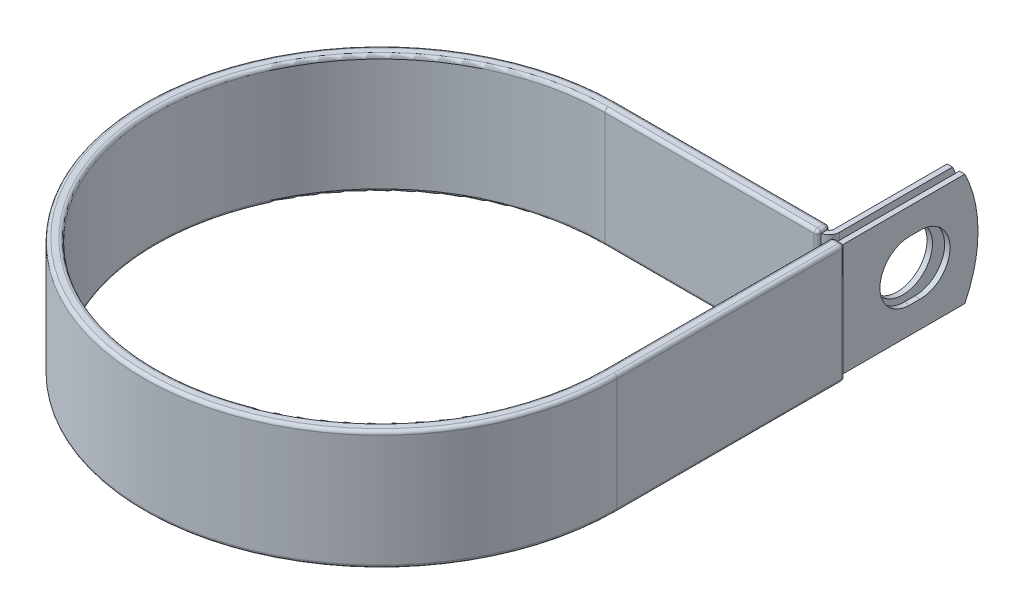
ISO-10303-21;
HEADER;
FILE_DESCRIPTION(('STEP AP214'),'2;1');
FILE_NAME('part.step','',(''),(''),'','','');
FILE_SCHEMA(('AUTOMOTIVE_DESIGN { 1 0 10303 214 1 1 1 1 }'));
ENDSEC;
DATA;
#1=APPLICATION_CONTEXT('core data for automotive mechanical design processes');
#2=APPLICATION_PROTOCOL_DEFINITION('international standard','automotive_design',2000,#1);
#3=PRODUCT_CONTEXT('',#1,'mechanical');
#4=PRODUCT('Part','Part','',(#3));
#5=PRODUCT_RELATED_PRODUCT_CATEGORY('part','',(#4));
#6=PRODUCT_DEFINITION_FORMATION('','',#4);
#7=PRODUCT_DEFINITION_CONTEXT('part definition',#1,'design');
#8=PRODUCT_DEFINITION('design','',#6,#7);
#9=PRODUCT_DEFINITION_SHAPE('','',#8);
#10=(LENGTH_UNIT() NAMED_UNIT(*) SI_UNIT(.MILLI.,.METRE.));
#11=(NAMED_UNIT(*) PLANE_ANGLE_UNIT() SI_UNIT($,.RADIAN.));
#12=(NAMED_UNIT(*) SI_UNIT($,.STERADIAN.) SOLID_ANGLE_UNIT());
#13=UNCERTAINTY_MEASURE_WITH_UNIT(LENGTH_MEASURE(1.E-05),#10,'distance_accuracy_value','');
#14=(GEOMETRIC_REPRESENTATION_CONTEXT(3) GLOBAL_UNCERTAINTY_ASSIGNED_CONTEXT((#13)) GLOBAL_UNIT_ASSIGNED_CONTEXT((#10,
#11,#12)) REPRESENTATION_CONTEXT('',''));
#15=CARTESIAN_POINT('',(0.,0.,0.));
#16=DIRECTION('',(0.,0.,1.));
#17=DIRECTION('',(1.,0.,0.));
#18=AXIS2_PLACEMENT_3D('',#15,#16,#17);
#19=CARTESIAN_POINT('',(50.01895,12.7,-82.5246));
#20=DIRECTION('',(1.,0.,0.));
#21=DIRECTION('',(0.,0.,-1.));
#22=AXIS2_PLACEMENT_3D('',#19,#20,#21);
#23=PLANE('',#22);
#24=CARTESIAN_POINT('',(50.01895,0.,-68.2498));
#25=DIRECTION('',(1.,0.,0.));
#26=DIRECTION('',(0.,0.,-1.));
#27=AXIS2_PLACEMENT_3D('',#24,#25,#26);
#28=CIRCLE('',#27,6.7437);
#29=CARTESIAN_POINT('',(50.01895,0.,-74.9935));
#30=VERTEX_POINT('',#29);
#31=EDGE_CURVE('E460',#30,#30,#28,.F.);
#32=ORIENTED_EDGE('',*,*,#31,.T.);
#33=EDGE_LOOP('',(#32));
#34=FACE_BOUND('',#33,.T.);
#35=DIRECTION('',(0.,0.,1.));
#36=VECTOR('',#35,1.);
#37=CARTESIAN_POINT('',(50.01895,-12.7,-82.5246));
#38=LINE('',#37,#36);
#39=CARTESIAN_POINT('',(50.01895,-12.7,-79.5472683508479));
#40=VERTEX_POINT('',#39);
#41=CARTESIAN_POINT('',(50.01895,-12.7,-53.97119));
#42=VERTEX_POINT('',#41);
#43=EDGE_CURVE('E482',#40,#42,#38,.T.);
#44=ORIENTED_EDGE('',*,*,#43,.F.);
#45=CARTESIAN_POINT('',(50.01895,0.,-53.9496));
#46=DIRECTION('',(1.,0.,0.));
#47=DIRECTION('',(0.,0.,-1.));
#48=AXIS2_PLACEMENT_3D('',#45,#46,#47);
#49=CIRCLE('',#48,28.575);
#50=CARTESIAN_POINT('',(50.01895,12.7,-79.5472683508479));
#51=VERTEX_POINT('',#50);
#52=EDGE_CURVE('E419',#40,#51,#49,.T.);
#53=ORIENTED_EDGE('',*,*,#52,.T.);
#54=DIRECTION('',(0.,0.,1.));
#55=VECTOR('',#54,1.);
#56=CARTESIAN_POINT('',(50.01895,12.7,-82.5246));
#57=LINE('',#56,#55);
#58=CARTESIAN_POINT('',(50.01895,12.7,-53.97119));
#59=VERTEX_POINT('',#58);
#60=EDGE_CURVE('E472',#51,#59,#57,.T.);
#61=ORIENTED_EDGE('',*,*,#60,.T.);
#62=DIRECTION('',(0.,-1.,0.));
#63=VECTOR('',#62,1.);
#64=CARTESIAN_POINT('',(50.01895,12.7,-53.97119));
#65=LINE('',#64,#63);
#66=EDGE_CURVE('E489',#59,#42,#65,.T.);
#67=ORIENTED_EDGE('',*,*,#66,.T.);
#68=EDGE_LOOP('',(#44,#53,#61,#67));
#69=FACE_BOUND('',#68,.T.);
#70=ADVANCED_FACE('F54',(#34,#69),#23,.T.);
#71=CARTESIAN_POINT('',(48.79975,12.7,-82.5246));
#72=DIRECTION('',(1.,0.,0.));
#73=DIRECTION('',(0.,0.,-1.));
#74=AXIS2_PLACEMENT_3D('',#71,#72,#73);
#75=PLANE('',#74);
#76=CARTESIAN_POINT('',(48.79975,0.,-68.2498));
#77=DIRECTION('',(-1.,0.,0.));
#78=DIRECTION('',(0.,0.,1.));
#79=AXIS2_PLACEMENT_3D('',#76,#77,#78);
#80=CIRCLE('',#79,6.7437);
#81=CARTESIAN_POINT('',(48.79975,0.,-61.5061));
#82=VERTEX_POINT('',#81);
#83=EDGE_CURVE('E457',#82,#82,#80,.T.);
#84=ORIENTED_EDGE('',*,*,#83,.F.);
#85=EDGE_LOOP('',(#84));
#86=FACE_BOUND('',#85,.T.);
#87=CARTESIAN_POINT('',(48.79975,0.,-53.9496));
#88=DIRECTION('',(-1.,0.,0.));
#89=DIRECTION('',(0.,0.,1.));
#90=AXIS2_PLACEMENT_3D('',#87,#88,#89);
#91=CIRCLE('',#90,28.575);
#92=CARTESIAN_POINT('',(48.79975,12.7,-79.5472683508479));
#93=VERTEX_POINT('',#92);
#94=CARTESIAN_POINT('',(48.79975,-12.7,-79.5472683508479));
#95=VERTEX_POINT('',#94);
#96=EDGE_CURVE('E411',#93,#95,#91,.T.);
#97=ORIENTED_EDGE('',*,*,#96,.T.);
#98=DIRECTION('',(0.,0.,1.));
#99=VECTOR('',#98,1.);
#100=CARTESIAN_POINT('',(48.79975,-12.7,-82.5246));
#101=LINE('',#100,#99);
#102=CARTESIAN_POINT('',(48.79975,-12.7,-53.97119));
#103=VERTEX_POINT('',#102);
#104=EDGE_CURVE('E484',#95,#103,#101,.T.);
#105=ORIENTED_EDGE('',*,*,#104,.T.);
#106=DIRECTION('',(0.,-1.,0.));
#107=VECTOR('',#106,1.);
#108=CARTESIAN_POINT('',(48.79975,12.7,-53.97119));
#109=LINE('',#108,#107);
#110=CARTESIAN_POINT('',(48.79975,12.7,-53.97119));
#111=VERTEX_POINT('',#110);
#112=EDGE_CURVE('E477',#111,#103,#109,.T.);
#113=ORIENTED_EDGE('',*,*,#112,.F.);
#114=DIRECTION('',(0.,0.,1.));
#115=VECTOR('',#114,1.);
#116=CARTESIAN_POINT('',(48.79975,12.7,-82.5246));
#117=LINE('',#116,#115);
#118=EDGE_CURVE('E474',#93,#111,#117,.T.);
#119=ORIENTED_EDGE('',*,*,#118,.F.);
#120=EDGE_LOOP('',(#97,#105,#113,#119));
#121=FACE_BOUND('',#120,.T.);
#122=ADVANCED_FACE('F788',(#86,#121),#75,.F.);
#123=CARTESIAN_POINT('',(0.,-12.7,0.));
#124=DIRECTION('',(0.,1.,0.));
#125=DIRECTION('',(1.,0.,0.));
#126=AXIS2_PLACEMENT_3D('',#123,#124,#125);
#127=PLANE('',#126);
#128=CARTESIAN_POINT('',(47.64151,-12.7,-53.97119));
#129=DIRECTION('',(0.,-1.,0.));
#130=DIRECTION('',(0.,0.,1.));
#131=AXIS2_PLACEMENT_3D('',#128,#129,#130);
#132=CIRCLE('',#131,2.37744);
#133=CARTESIAN_POINT('',(48.1647500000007,-12.7,-51.6520434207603));
#134=VERTEX_POINT('',#133);
#135=EDGE_CURVE('E479',#42,#134,#132,.T.);
#136=ORIENTED_EDGE('',*,*,#135,.T.);
#137=DIRECTION('',(0.,0.,-1.));
#138=VECTOR('',#137,1.);
#139=CARTESIAN_POINT('',(48.1647500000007,-12.7,-52.81295));
#140=LINE('',#139,#138);
#141=CARTESIAN_POINT('',(48.1647500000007,-12.7,-52.8447));
#142=VERTEX_POINT('',#141);
#143=EDGE_CURVE('E368',#134,#142,#140,.T.);
#144=ORIENTED_EDGE('',*,*,#143,.T.);
#145=CARTESIAN_POINT('',(47.4027500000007,-12.7,-52.8447));
#146=DIRECTION('',(0.,1.,0.));
#147=DIRECTION('',(0.,0.,1.));
#148=AXIS2_PLACEMENT_3D('',#145,#146,#147);
#149=CIRCLE('',#148,0.762);
#150=CARTESIAN_POINT('',(48.1593610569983,-12.7,-52.9351638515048));
#151=VERTEX_POINT('',#150);
#152=EDGE_CURVE('E554',#142,#151,#149,.T.);
#153=ORIENTED_EDGE('',*,*,#152,.T.);
#154=CARTESIAN_POINT('',(47.64151,-12.7,-53.97119));
#155=DIRECTION('',(0.,1.,0.));
#156=DIRECTION('',(1.,0.,0.));
#157=AXIS2_PLACEMENT_3D('',#154,#155,#156);
#158=CIRCLE('',#157,1.15824);
#159=EDGE_CURVE('E77',#103,#151,#158,.F.);
#160=ORIENTED_EDGE('',*,*,#159,.F.);
#161=ORIENTED_EDGE('',*,*,#104,.F.);
#162=DIRECTION('',(-1.,0.,0.));
#163=VECTOR('',#162,1.);
#164=CARTESIAN_POINT('',(52.81295,-12.7,-79.5472683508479));
#165=LINE('',#164,#163);
#166=EDGE_CURVE('E498',#40,#95,#165,.T.);
#167=ORIENTED_EDGE('',*,*,#166,.F.);
#168=ORIENTED_EDGE('',*,*,#43,.T.);
#169=EDGE_LOOP('',(#136,#144,#153,#160,#161,#167,#168));
#170=FACE_BOUND('',#169,.T.);
#171=ADVANCED_FACE('F794',(#170),#127,.F.);
#172=CARTESIAN_POINT('',(0.,12.7,0.));
#173=DIRECTION('',(0.,1.,0.));
#174=DIRECTION('',(1.,0.,0.));
#175=AXIS2_PLACEMENT_3D('',#172,#173,#174);
#176=PLANE('',#175);
#177=DIRECTION('',(0.,0.,-1.));
#178=VECTOR('',#177,1.);
#179=CARTESIAN_POINT('',(48.16475,12.7,6.75614543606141E-13));
#180=LINE('',#179,#178);
#181=CARTESIAN_POINT('',(48.1647500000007,12.7,-51.6520434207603));
#182=VERTEX_POINT('',#181);
#183=CARTESIAN_POINT('',(48.1647500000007,12.7,-52.8447));
#184=VERTEX_POINT('',#183);
#185=EDGE_CURVE('E405',#182,#184,#180,.T.);
#186=ORIENTED_EDGE('',*,*,#185,.F.);
#187=CARTESIAN_POINT('',(47.64151,12.7,-53.97119));
#188=DIRECTION('',(0.,-1.,0.));
#189=DIRECTION('',(0.,0.,1.));
#190=AXIS2_PLACEMENT_3D('',#187,#188,#189);
#191=CIRCLE('',#190,2.37744);
#192=EDGE_CURVE('E469',#59,#182,#191,.T.);
#193=ORIENTED_EDGE('',*,*,#192,.F.);
#194=ORIENTED_EDGE('',*,*,#60,.F.);
#195=DIRECTION('',(-1.,0.,0.));
#196=VECTOR('',#195,1.);
#197=CARTESIAN_POINT('',(52.81295,12.7,-79.5472683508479));
#198=LINE('',#197,#196);
#199=EDGE_CURVE('E495',#51,#93,#198,.T.);
#200=ORIENTED_EDGE('',*,*,#199,.T.);
#201=ORIENTED_EDGE('',*,*,#118,.T.);
#202=CARTESIAN_POINT('',(47.64151,12.7,-53.97119));
#203=DIRECTION('',(0.,1.,0.));
#204=DIRECTION('',(1.,0.,0.));
#205=AXIS2_PLACEMENT_3D('',#202,#203,#204);
#206=CIRCLE('',#205,1.15824);
#207=CARTESIAN_POINT('',(48.1593610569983,12.7,-52.9351638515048));
#208=VERTEX_POINT('',#207);
#209=EDGE_CURVE('E70',#111,#208,#206,.F.);
#210=ORIENTED_EDGE('',*,*,#209,.T.);
#211=CARTESIAN_POINT('',(47.4027500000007,12.7,-52.8447));
#212=DIRECTION('',(0.,1.,0.));
#213=DIRECTION('',(0.,0.,1.));
#214=AXIS2_PLACEMENT_3D('',#211,#212,#213);
#215=CIRCLE('',#214,0.762);
#216=EDGE_CURVE('E12',#208,#184,#215,.F.);
#217=ORIENTED_EDGE('',*,*,#216,.T.);
#218=EDGE_LOOP('',(#186,#193,#194,#200,#201,#210,#217));
#219=FACE_BOUND('',#218,.T.);
#220=ADVANCED_FACE('F802',(#219),#176,.T.);
#221=CARTESIAN_POINT('',(47.64151,12.7,-53.97119));
#222=DIRECTION('',(0.,-1.,0.));
#223=DIRECTION('',(0.,0.,-1.));
#224=AXIS2_PLACEMENT_3D('',#221,#222,#223);
#225=CYLINDRICAL_SURFACE('',#224,2.37744);
#226=ORIENTED_EDGE('',*,*,#135,.F.);
#227=ORIENTED_EDGE('',*,*,#66,.F.);
#228=ORIENTED_EDGE('',*,*,#192,.T.);
#229=CARTESIAN_POINT('',(47.64151,12.7,-53.97119));
#230=DIRECTION('',(0.,-1.,0.));
#231=DIRECTION('',(0.,0.,-1.));
#232=AXIS2_PLACEMENT_3D('',#229,#230,#231);
#233=CIRCLE('',#232,2.37744);
#234=CARTESIAN_POINT('',(47.64151,12.7,-51.59375));
#235=VERTEX_POINT('',#234);
#236=EDGE_CURVE('E402',#235,#182,#233,.F.);
#237=ORIENTED_EDGE('',*,*,#236,.F.);
#238=DIRECTION('',(0.,-1.,0.));
#239=VECTOR('',#238,1.);
#240=CARTESIAN_POINT('',(47.64151,12.7,-51.59375));
#241=LINE('',#240,#239);
#242=CARTESIAN_POINT('',(47.64151,-12.7,-51.59375));
#243=VERTEX_POINT('',#242);
#244=EDGE_CURVE('E492',#235,#243,#241,.T.);
#245=ORIENTED_EDGE('',*,*,#244,.T.);
#246=CARTESIAN_POINT('',(47.64151,-12.7,-53.97119));
#247=DIRECTION('',(0.,1.,0.));
#248=DIRECTION('',(0.,0.,1.));
#249=AXIS2_PLACEMENT_3D('',#246,#247,#248);
#250=CIRCLE('',#249,2.37744);
#251=EDGE_CURVE('E400',#134,#243,#250,.F.);
#252=ORIENTED_EDGE('',*,*,#251,.F.);
#253=EDGE_LOOP('',(#226,#227,#228,#237,#245,#252));
#254=FACE_BOUND('',#253,.T.);
#255=ADVANCED_FACE('F799',(#254),#225,.T.);
#256=CARTESIAN_POINT('',(47.64151,12.7,-53.97119));
#257=DIRECTION('',(0.,-1.,0.));
#258=DIRECTION('',(0.,0.,-1.));
#259=AXIS2_PLACEMENT_3D('',#256,#257,#258);
#260=CYLINDRICAL_SURFACE('',#259,1.15824);
#261=ORIENTED_EDGE('',*,*,#159,.T.);
#262=DIRECTION('',(0.,1.,0.));
#263=VECTOR('',#262,1.);
#264=CARTESIAN_POINT('',(48.1593610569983,-12.7,-52.9351638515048));
#265=LINE('',#264,#263);
#266=EDGE_CURVE('E63',#151,#208,#265,.T.);
#267=ORIENTED_EDGE('',*,*,#266,.T.);
#268=ORIENTED_EDGE('',*,*,#209,.F.);
#269=ORIENTED_EDGE('',*,*,#112,.T.);
#270=EDGE_LOOP('',(#261,#267,#268,#269));
#271=FACE_BOUND('',#270,.T.);
#272=ADVANCED_FACE('F801',(#271),#260,.F.);
#273=CARTESIAN_POINT('',(69.0930140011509,0.,-68.2498));
#274=DIRECTION('',(-1.,0.,0.));
#275=DIRECTION('',(0.,0.,1.));
#276=AXIS2_PLACEMENT_3D('',#273,#274,#275);
#277=CYLINDRICAL_SURFACE('',#276,6.7437);
#278=ORIENTED_EDGE('',*,*,#83,.T.);
#279=EDGE_LOOP('',(#278));
#280=FACE_BOUND('',#279,.T.);
#281=ORIENTED_EDGE('',*,*,#31,.F.);
#282=EDGE_LOOP('',(#281));
#283=FACE_BOUND('',#282,.T.);
#284=ADVANCED_FACE('F808',(#280,#283),#277,.F.);
#285=CARTESIAN_POINT('',(52.81295,0.,-53.9496));
#286=DIRECTION('',(-1.,0.,0.));
#287=DIRECTION('',(0.,0.,1.));
#288=AXIS2_PLACEMENT_3D('',#285,#286,#287);
#289=CYLINDRICAL_SURFACE('',#288,28.575);
#290=ORIENTED_EDGE('',*,*,#52,.F.);
#291=ORIENTED_EDGE('',*,*,#166,.T.);
#292=ORIENTED_EDGE('',*,*,#96,.F.);
#293=ORIENTED_EDGE('',*,*,#199,.F.);
#294=EDGE_LOOP('',(#290,#291,#292,#293));
#295=FACE_BOUND('',#294,.T.);
#296=ADVANCED_FACE('F859',(#295),#289,.T.);
#297=CARTESIAN_POINT('',(7.23713667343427E-13,-12.7,-51.59375));
#298=DIRECTION('',(0.,0.,1.));
#299=DIRECTION('',(1.,0.,0.));
#300=AXIS2_PLACEMENT_3D('',#297,#298,#299);
#301=PLANE('',#300);
#302=DIRECTION('',(1.,0.,0.));
#303=VECTOR('',#302,1.);
#304=CARTESIAN_POINT('',(7.23713667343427E-13,-12.7,-51.59375));
#305=LINE('',#304,#303);
#306=CARTESIAN_POINT('',(48.1647500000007,-12.7,-51.59375));
#307=VERTEX_POINT('',#306);
#308=EDGE_CURVE('E375',#243,#307,#305,.T.);
#309=ORIENTED_EDGE('',*,*,#308,.F.);
#310=ORIENTED_EDGE('',*,*,#244,.F.);
#311=DIRECTION('',(1.,0.,0.));
#312=VECTOR('',#311,1.);
#313=CARTESIAN_POINT('',(7.23713667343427E-13,12.7,-51.59375));
#314=LINE('',#313,#312);
#315=CARTESIAN_POINT('',(48.1647500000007,12.7,-51.59375));
#316=VERTEX_POINT('',#315);
#317=EDGE_CURVE('E377',#235,#316,#314,.T.);
#318=ORIENTED_EDGE('',*,*,#317,.T.);
#319=DIRECTION('',(0.,-1.,0.));
#320=VECTOR('',#319,1.);
#321=CARTESIAN_POINT('',(48.1647500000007,-12.7,-51.59375));
#322=LINE('',#321,#320);
#323=EDGE_CURVE('E307',#316,#307,#322,.T.);
#324=ORIENTED_EDGE('',*,*,#323,.T.);
#325=EDGE_LOOP('',(#309,#310,#318,#324));
#326=FACE_BOUND('',#325,.T.);
#327=ADVANCED_FACE('F831',(#326),#301,.F.);
#328=CARTESIAN_POINT('',(48.1647500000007,-12.73175,-51.562));
#329=DIRECTION('',(1.,0.,0.));
#330=DIRECTION('',(0.,0.,-1.));
#331=AXIS2_PLACEMENT_3D('',#328,#329,#330);
#332=PLANE('',#331);
#333=DIRECTION('',(0.,0.,-1.));
#334=VECTOR('',#333,1.);
#335=CARTESIAN_POINT('',(48.1647500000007,-12.73175,-52.8447));
#336=LINE('',#335,#334);
#337=CARTESIAN_POINT('',(48.1647500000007,-12.73175,-51.562));
#338=VERTEX_POINT('',#337);
#339=CARTESIAN_POINT('',(48.1647500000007,-12.73175,-52.8447));
#340=VERTEX_POINT('',#339);
#341=EDGE_CURVE('E508',#338,#340,#336,.T.);
#342=ORIENTED_EDGE('',*,*,#341,.T.);
#343=DIRECTION('',(0.,1.,0.));
#344=VECTOR('',#343,1.);
#345=CARTESIAN_POINT('',(48.1647500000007,-12.73175,-52.8447));
#346=LINE('',#345,#344);
#347=EDGE_CURVE('E512',#340,#142,#346,.T.);
#348=ORIENTED_EDGE('',*,*,#347,.T.);
#349=ORIENTED_EDGE('',*,*,#143,.F.);
#350=EDGE_CURVE('E369',#307,#134,#140,.T.);
#351=ORIENTED_EDGE('',*,*,#350,.F.);
#352=ORIENTED_EDGE('',*,*,#323,.F.);
#353=DIRECTION('',(0.,0.,1.));
#354=VECTOR('',#353,1.);
#355=CARTESIAN_POINT('',(48.1647500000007,12.7,-51.59375));
#356=LINE('',#355,#354);
#357=EDGE_CURVE('E372',#182,#316,#356,.T.);
#358=ORIENTED_EDGE('',*,*,#357,.F.);
#359=ORIENTED_EDGE('',*,*,#185,.T.);
#360=DIRECTION('',(0.,1.,0.));
#361=VECTOR('',#360,1.);
#362=CARTESIAN_POINT('',(48.1647500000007,-12.73175,-52.8447));
#363=LINE('',#362,#361);
#364=CARTESIAN_POINT('',(48.1647500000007,12.73175,-52.8447));
#365=VERTEX_POINT('',#364);
#366=EDGE_CURVE('E510',#184,#365,#363,.T.);
#367=ORIENTED_EDGE('',*,*,#366,.T.);
#368=DIRECTION('',(0.,0.,1.));
#369=VECTOR('',#368,1.);
#370=CARTESIAN_POINT('',(48.1647500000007,12.73175,-51.562));
#371=LINE('',#370,#369);
#372=CARTESIAN_POINT('',(48.1647500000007,12.73175,-51.562));
#373=VERTEX_POINT('',#372);
#374=EDGE_CURVE('E504',#365,#373,#371,.T.);
#375=ORIENTED_EDGE('',*,*,#374,.T.);
#376=DIRECTION('',(0.,-1.,0.));
#377=VECTOR('',#376,1.);
#378=CARTESIAN_POINT('',(48.1647500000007,-12.73175,-51.562));
#379=LINE('',#378,#377);
#380=EDGE_CURVE('E506',#373,#338,#379,.T.);
#381=ORIENTED_EDGE('',*,*,#380,.T.);
#382=EDGE_LOOP('',(#342,#348,#349,#351,#352,#358,#359,#367,#375,#381));
#383=FACE_BOUND('',#382,.T.);
#384=ADVANCED_FACE('F827',(#383),#332,.T.);
#385=CARTESIAN_POINT('',(7.412609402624E-13,-12.73175,-52.8447));
#386=DIRECTION('',(1.,0.,0.));
#387=DIRECTION('',(0.,0.,-1.));
#388=AXIS2_PLACEMENT_3D('',#385,#386,#387);
#389=CYLINDRICAL_SURFACE('',#388,0.761999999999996);
#390=DIRECTION('',(1.,0.,0.));
#391=VECTOR('',#390,1.);
#392=CARTESIAN_POINT('',(7.51949634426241E-13,-12.73175,-53.6067));
#393=LINE('',#392,#391);
#394=CARTESIAN_POINT('',(7.51949634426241E-13,-12.73175,-53.6067));
#395=VERTEX_POINT('',#394);
#396=CARTESIAN_POINT('',(47.4027500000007,-12.73175,-53.6067));
#397=VERTEX_POINT('',#396);
#398=EDGE_CURVE('E394',#395,#397,#393,.T.);
#399=ORIENTED_EDGE('',*,*,#398,.T.);
#400=CARTESIAN_POINT('',(47.4027500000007,-12.73175,-52.8447));
#401=DIRECTION('',(1.,0.,0.));
#402=DIRECTION('',(0.,0.,-1.));
#403=AXIS2_PLACEMENT_3D('',#400,#401,#402);
#404=CIRCLE('',#403,0.761999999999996);
#405=CARTESIAN_POINT('',(47.4027500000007,-13.49375,-52.8447));
#406=VERTEX_POINT('',#405);
#407=EDGE_CURVE('E517',#397,#406,#404,.F.);
#408=ORIENTED_EDGE('',*,*,#407,.T.);
#409=DIRECTION('',(1.,0.,0.));
#410=VECTOR('',#409,1.);
#411=CARTESIAN_POINT('',(7.412609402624E-13,-13.49375,-52.8447));
#412=LINE('',#411,#410);
#413=CARTESIAN_POINT('',(7.412609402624E-13,-13.49375,-52.8447));
#414=VERTEX_POINT('',#413);
#415=EDGE_CURVE('E397',#414,#406,#412,.T.);
#416=ORIENTED_EDGE('',*,*,#415,.F.);
#417=CARTESIAN_POINT('',(7.412609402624E-13,-12.73175,-52.8447));
#418=DIRECTION('',(1.,0.,0.));
#419=DIRECTION('',(0.,0.,1.));
#420=AXIS2_PLACEMENT_3D('',#417,#418,#419);
#421=CIRCLE('',#420,0.761999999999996);
#422=EDGE_CURVE('E345',#414,#395,#421,.T.);
#423=ORIENTED_EDGE('',*,*,#422,.T.);
#424=EDGE_LOOP('',(#399,#408,#416,#423));
#425=FACE_BOUND('',#424,.T.);
#426=ADVANCED_FACE('F670',(#425),#389,.T.);
#427=CARTESIAN_POINT('',(7.51949634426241E-13,12.73175,-53.6067));
#428=DIRECTION('',(0.,0.,-1.));
#429=DIRECTION('',(0.,1.,0.));
#430=AXIS2_PLACEMENT_3D('',#427,#428,#429);
#431=PLANE('',#430);
#432=DIRECTION('',(1.,0.,0.));
#433=VECTOR('',#432,1.);
#434=CARTESIAN_POINT('',(7.51949634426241E-13,12.73175,-53.6067));
#435=LINE('',#434,#433);
#436=CARTESIAN_POINT('',(7.51949634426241E-13,12.73175,-53.6067));
#437=VERTEX_POINT('',#436);
#438=CARTESIAN_POINT('',(47.4027500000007,12.73175,-53.6067));
#439=VERTEX_POINT('',#438);
#440=EDGE_CURVE('E391',#437,#439,#435,.T.);
#441=ORIENTED_EDGE('',*,*,#440,.T.);
#442=DIRECTION('',(0.,1.,0.));
#443=VECTOR('',#442,1.);
#444=CARTESIAN_POINT('',(47.4027500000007,12.73175,-53.6067));
#445=LINE('',#444,#443);
#446=EDGE_CURVE('E515',#439,#397,#445,.F.);
#447=ORIENTED_EDGE('',*,*,#446,.T.);
#448=ORIENTED_EDGE('',*,*,#398,.F.);
#449=DIRECTION('',(0.,1.,0.));
#450=VECTOR('',#449,1.);
#451=CARTESIAN_POINT('',(7.51949634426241E-13,12.73175,-53.6067));
#452=LINE('',#451,#450);
#453=EDGE_CURVE('E342',#395,#437,#452,.T.);
#454=ORIENTED_EDGE('',*,*,#453,.T.);
#455=EDGE_LOOP('',(#441,#447,#448,#454));
#456=FACE_BOUND('',#455,.T.);
#457=ADVANCED_FACE('F676',(#456),#431,.T.);
#458=CARTESIAN_POINT('',(7.412609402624E-13,12.73175,-52.8447));
#459=DIRECTION('',(1.,0.,0.));
#460=DIRECTION('',(0.,0.,-1.));
#461=AXIS2_PLACEMENT_3D('',#458,#459,#460);
#462=CYLINDRICAL_SURFACE('',#461,0.762);
#463=DIRECTION('',(1.,0.,0.));
#464=VECTOR('',#463,1.);
#465=CARTESIAN_POINT('',(7.412609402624E-13,13.49375,-52.8447));
#466=LINE('',#465,#464);
#467=CARTESIAN_POINT('',(7.412609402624E-13,13.49375,-52.8447));
#468=VERTEX_POINT('',#467);
#469=CARTESIAN_POINT('',(47.4027500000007,13.49375,-52.8447));
#470=VERTEX_POINT('',#469);
#471=EDGE_CURVE('E388',#468,#470,#466,.T.);
#472=ORIENTED_EDGE('',*,*,#471,.T.);
#473=CARTESIAN_POINT('',(47.4027500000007,12.73175,-52.8447));
#474=DIRECTION('',(1.,0.,0.));
#475=DIRECTION('',(0.,0.,-1.));
#476=AXIS2_PLACEMENT_3D('',#473,#474,#475);
#477=CIRCLE('',#476,0.762);
#478=EDGE_CURVE('E501',#470,#439,#477,.F.);
#479=ORIENTED_EDGE('',*,*,#478,.T.);
#480=ORIENTED_EDGE('',*,*,#440,.F.);
#481=CARTESIAN_POINT('',(7.412609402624E-13,12.73175,-52.8447));
#482=DIRECTION('',(1.,0.,0.));
#483=DIRECTION('',(0.,0.,1.));
#484=AXIS2_PLACEMENT_3D('',#481,#482,#483);
#485=CIRCLE('',#484,0.762);
#486=EDGE_CURVE('E339',#437,#468,#485,.T.);
#487=ORIENTED_EDGE('',*,*,#486,.T.);
#488=EDGE_LOOP('',(#472,#479,#480,#487));
#489=FACE_BOUND('',#488,.T.);
#490=ADVANCED_FACE('F680',(#489),#462,.T.);
#491=CARTESIAN_POINT('',(7.232683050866E-13,12.73175,-51.562));
#492=DIRECTION('',(1.,0.,0.));
#493=DIRECTION('',(0.,0.,-1.));
#494=AXIS2_PLACEMENT_3D('',#491,#492,#493);
#495=CYLINDRICAL_SURFACE('',#494,0.762);
#496=DIRECTION('',(1.,0.,0.));
#497=VECTOR('',#496,1.);
#498=CARTESIAN_POINT('',(7.12579610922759E-13,12.73175,-50.8));
#499=LINE('',#498,#497);
#500=CARTESIAN_POINT('',(7.12579610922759E-13,12.73175,-50.8));
#501=VERTEX_POINT('',#500);
#502=CARTESIAN_POINT('',(47.4027500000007,12.73175,-50.8));
#503=VERTEX_POINT('',#502);
#504=EDGE_CURVE('E382',#501,#503,#499,.T.);
#505=ORIENTED_EDGE('',*,*,#504,.T.);
#506=CARTESIAN_POINT('',(47.4027500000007,12.73175,-51.562));
#507=DIRECTION('',(1.,0.,0.));
#508=DIRECTION('',(0.,0.,-1.));
#509=AXIS2_PLACEMENT_3D('',#506,#507,#508);
#510=CIRCLE('',#509,0.762);
#511=CARTESIAN_POINT('',(47.4027500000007,13.49375,-51.562));
#512=VERTEX_POINT('',#511);
#513=EDGE_CURVE('E527',#503,#512,#510,.F.);
#514=ORIENTED_EDGE('',*,*,#513,.T.);
#515=DIRECTION('',(1.,0.,0.));
#516=VECTOR('',#515,1.);
#517=CARTESIAN_POINT('',(7.232683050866E-13,13.49375,-51.562));
#518=LINE('',#517,#516);
#519=CARTESIAN_POINT('',(7.232683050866E-13,13.49375,-51.562));
#520=VERTEX_POINT('',#519);
#521=EDGE_CURVE('E385',#520,#512,#518,.T.);
#522=ORIENTED_EDGE('',*,*,#521,.F.);
#523=CARTESIAN_POINT('',(7.232683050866E-13,12.73175,-51.562));
#524=DIRECTION('',(1.,0.,0.));
#525=DIRECTION('',(0.,0.,1.));
#526=AXIS2_PLACEMENT_3D('',#523,#524,#525);
#527=CIRCLE('',#526,0.762);
#528=EDGE_CURVE('E336',#520,#501,#527,.T.);
#529=ORIENTED_EDGE('',*,*,#528,.T.);
#530=EDGE_LOOP('',(#505,#514,#522,#529));
#531=FACE_BOUND('',#530,.T.);
#532=ADVANCED_FACE('F721',(#531),#495,.T.);
#533=CARTESIAN_POINT('',(7.12579610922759E-13,-12.73175,-50.8));
#534=DIRECTION('',(0.,0.,1.));
#535=DIRECTION('',(1.,0.,0.));
#536=AXIS2_PLACEMENT_3D('',#533,#534,#535);
#537=PLANE('',#536);
#538=DIRECTION('',(1.,0.,0.));
#539=VECTOR('',#538,1.);
#540=CARTESIAN_POINT('',(7.12579610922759E-13,-12.73175,-50.8));
#541=LINE('',#540,#539);
#542=CARTESIAN_POINT('',(7.12579610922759E-13,-12.73175,-50.8));
#543=VERTEX_POINT('',#542);
#544=CARTESIAN_POINT('',(47.4027500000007,-12.73175,-50.8));
#545=VERTEX_POINT('',#544);
#546=EDGE_CURVE('E379',#543,#545,#541,.T.);
#547=ORIENTED_EDGE('',*,*,#546,.T.);
#548=DIRECTION('',(0.,-1.,0.));
#549=VECTOR('',#548,1.);
#550=CARTESIAN_POINT('',(47.4027500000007,-12.73175,-50.8));
#551=LINE('',#550,#549);
#552=EDGE_CURVE('E525',#545,#503,#551,.F.);
#553=ORIENTED_EDGE('',*,*,#552,.T.);
#554=ORIENTED_EDGE('',*,*,#504,.F.);
#555=DIRECTION('',(0.,-1.,0.));
#556=VECTOR('',#555,1.);
#557=CARTESIAN_POINT('',(7.12579610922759E-13,-12.73175,-50.8));
#558=LINE('',#557,#556);
#559=EDGE_CURVE('E327',#501,#543,#558,.T.);
#560=ORIENTED_EDGE('',*,*,#559,.T.);
#561=EDGE_LOOP('',(#547,#553,#554,#560));
#562=FACE_BOUND('',#561,.T.);
#563=ADVANCED_FACE('F719',(#562),#537,.T.);
#564=CARTESIAN_POINT('',(7.232683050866E-13,-12.73175,-51.562));
#565=DIRECTION('',(1.,0.,0.));
#566=DIRECTION('',(0.,0.,-1.));
#567=AXIS2_PLACEMENT_3D('',#564,#565,#566);
#568=CYLINDRICAL_SURFACE('',#567,0.762000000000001);
#569=DIRECTION('',(1.,0.,0.));
#570=VECTOR('',#569,1.);
#571=CARTESIAN_POINT('',(7.232683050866E-13,-13.49375,-51.562));
#572=LINE('',#571,#570);
#573=CARTESIAN_POINT('',(7.232683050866E-13,-13.49375,-51.562));
#574=VERTEX_POINT('',#573);
#575=CARTESIAN_POINT('',(47.4027500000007,-13.49375,-51.562));
#576=VERTEX_POINT('',#575);
#577=EDGE_CURVE('E303',#574,#576,#572,.T.);
#578=ORIENTED_EDGE('',*,*,#577,.T.);
#579=CARTESIAN_POINT('',(47.4027500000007,-12.73175,-51.562));
#580=DIRECTION('',(1.,0.,0.));
#581=DIRECTION('',(0.,0.,-1.));
#582=AXIS2_PLACEMENT_3D('',#579,#580,#581);
#583=CIRCLE('',#582,0.762000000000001);
#584=EDGE_CURVE('E523',#576,#545,#583,.F.);
#585=ORIENTED_EDGE('',*,*,#584,.T.);
#586=ORIENTED_EDGE('',*,*,#546,.F.);
#587=CARTESIAN_POINT('',(7.232683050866E-13,-12.73175,-51.562));
#588=DIRECTION('',(1.,0.,0.));
#589=DIRECTION('',(0.,0.,-1.));
#590=AXIS2_PLACEMENT_3D('',#587,#588,#589);
#591=CIRCLE('',#590,0.762000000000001);
#592=EDGE_CURVE('E324',#543,#574,#591,.T.);
#593=ORIENTED_EDGE('',*,*,#592,.T.);
#594=EDGE_LOOP('',(#578,#585,#586,#593));
#595=FACE_BOUND('',#594,.T.);
#596=ADVANCED_FACE('F709',(#595),#568,.T.);
#597=CARTESIAN_POINT('',(0.,-12.73175,0.));
#598=DIRECTION('',(0.,-1.,0.));
#599=DIRECTION('',(0.,0.,-1.));
#600=AXIS2_PLACEMENT_3D('',#597,#598,#599);
#601=TOROIDAL_SURFACE('',#600,52.8447,0.761999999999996);
#602=CARTESIAN_POINT('',(52.8447,-12.73175,0.));
#603=DIRECTION('',(0.,0.,1.));
#604=DIRECTION('',(-1.,0.,0.));
#605=AXIS2_PLACEMENT_3D('',#602,#603,#604);
#606=CIRCLE('',#605,0.761999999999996);
#607=CARTESIAN_POINT('',(52.8447,-13.49375,0.));
#608=VERTEX_POINT('',#607);
#609=CARTESIAN_POINT('',(53.6067,-12.73175,0.));
#610=VERTEX_POINT('',#609);
#611=EDGE_CURVE('E318',#608,#610,#606,.T.);
#612=ORIENTED_EDGE('',*,*,#611,.T.);
#613=CARTESIAN_POINT('',(0.,-12.73175,0.));
#614=DIRECTION('',(0.,-1.,0.));
#615=DIRECTION('',(0.,0.,-1.));
#616=AXIS2_PLACEMENT_3D('',#613,#614,#615);
#617=CIRCLE('',#616,53.6067);
#618=EDGE_CURVE('E361',#610,#395,#617,.T.);
#619=ORIENTED_EDGE('',*,*,#618,.T.);
#620=ORIENTED_EDGE('',*,*,#422,.F.);
#621=CARTESIAN_POINT('',(0.,-13.49375,0.));
#622=DIRECTION('',(0.,-1.,0.));
#623=DIRECTION('',(0.,0.,-1.));
#624=AXIS2_PLACEMENT_3D('',#621,#622,#623);
#625=CIRCLE('',#624,52.8447);
#626=EDGE_CURVE('E308',#608,#414,#625,.T.);
#627=ORIENTED_EDGE('',*,*,#626,.F.);
#628=EDGE_LOOP('',(#612,#619,#620,#627));
#629=FACE_BOUND('',#628,.T.);
#630=ADVANCED_FACE('F667',(#629),#601,.T.);
#631=CARTESIAN_POINT('',(0.,12.7,0.));
#632=DIRECTION('',(0.,-1.,0.));
#633=DIRECTION('',(0.,0.,-1.));
#634=AXIS2_PLACEMENT_3D('',#631,#632,#633);
#635=CYLINDRICAL_SURFACE('',#634,53.6067);
#636=DIRECTION('',(0.,1.,0.));
#637=VECTOR('',#636,1.);
#638=CARTESIAN_POINT('',(53.6067,12.73175,0.));
#639=LINE('',#638,#637);
#640=CARTESIAN_POINT('',(53.6067,12.73175,0.));
#641=VERTEX_POINT('',#640);
#642=EDGE_CURVE('E655',#610,#641,#639,.T.);
#643=ORIENTED_EDGE('',*,*,#642,.T.);
#644=CARTESIAN_POINT('',(0.,12.73175,0.));
#645=DIRECTION('',(0.,-1.,0.));
#646=DIRECTION('',(0.,0.,-1.));
#647=AXIS2_PLACEMENT_3D('',#644,#645,#646);
#648=CIRCLE('',#647,53.6067);
#649=EDGE_CURVE('E358',#641,#437,#648,.T.);
#650=ORIENTED_EDGE('',*,*,#649,.T.);
#651=ORIENTED_EDGE('',*,*,#453,.F.);
#652=ORIENTED_EDGE('',*,*,#618,.F.);
#653=EDGE_LOOP('',(#643,#650,#651,#652));
#654=FACE_BOUND('',#653,.T.);
#655=ADVANCED_FACE('F673',(#654),#635,.T.);
#656=CARTESIAN_POINT('',(0.,12.73175,0.));
#657=DIRECTION('',(0.,-1.,0.));
#658=DIRECTION('',(0.,0.,-1.));
#659=AXIS2_PLACEMENT_3D('',#656,#657,#658);
#660=TOROIDAL_SURFACE('',#659,52.8447,0.762);
#661=CARTESIAN_POINT('',(52.8447,12.73175,0.));
#662=DIRECTION('',(0.,0.,1.));
#663=DIRECTION('',(-1.,0.,0.));
#664=AXIS2_PLACEMENT_3D('',#661,#662,#663);
#665=CIRCLE('',#664,0.762);
#666=CARTESIAN_POINT('',(52.8447,13.49375,0.));
#667=VERTEX_POINT('',#666);
#668=EDGE_CURVE('E734',#641,#667,#665,.T.);
#669=ORIENTED_EDGE('',*,*,#668,.T.);
#670=CARTESIAN_POINT('',(0.,13.49375,0.));
#671=DIRECTION('',(0.,-1.,0.));
#672=DIRECTION('',(0.,0.,-1.));
#673=AXIS2_PLACEMENT_3D('',#670,#671,#672);
#674=CIRCLE('',#673,52.8447);
#675=EDGE_CURVE('E355',#667,#468,#674,.T.);
#676=ORIENTED_EDGE('',*,*,#675,.T.);
#677=ORIENTED_EDGE('',*,*,#486,.F.);
#678=ORIENTED_EDGE('',*,*,#649,.F.);
#679=EDGE_LOOP('',(#669,#676,#677,#678));
#680=FACE_BOUND('',#679,.T.);
#681=ADVANCED_FACE('F678',(#680),#660,.T.);
#682=CARTESIAN_POINT('',(0.,12.73175,0.));
#683=DIRECTION('',(0.,-1.,0.));
#684=DIRECTION('',(0.,0.,-1.));
#685=AXIS2_PLACEMENT_3D('',#682,#683,#684);
#686=TOROIDAL_SURFACE('',#685,51.562,0.762);
#687=CARTESIAN_POINT('',(51.562,12.73175,0.));
#688=DIRECTION('',(0.,0.,1.));
#689=DIRECTION('',(-1.,0.,0.));
#690=AXIS2_PLACEMENT_3D('',#687,#688,#689);
#691=CIRCLE('',#690,0.762);
#692=CARTESIAN_POINT('',(51.562,13.49375,0.));
#693=VERTEX_POINT('',#692);
#694=CARTESIAN_POINT('',(50.8,12.73175,0.));
#695=VERTEX_POINT('',#694);
#696=EDGE_CURVE('E730',#693,#695,#691,.T.);
#697=ORIENTED_EDGE('',*,*,#696,.T.);
#698=CARTESIAN_POINT('',(0.,12.73175,0.));
#699=DIRECTION('',(0.,-1.,0.));
#700=DIRECTION('',(0.,0.,-1.));
#701=AXIS2_PLACEMENT_3D('',#698,#699,#700);
#702=CIRCLE('',#701,50.8);
#703=EDGE_CURVE('E349',#695,#501,#702,.T.);
#704=ORIENTED_EDGE('',*,*,#703,.T.);
#705=ORIENTED_EDGE('',*,*,#528,.F.);
#706=CARTESIAN_POINT('',(0.,13.49375,0.));
#707=DIRECTION('',(0.,-1.,0.));
#708=DIRECTION('',(0.,0.,-1.));
#709=AXIS2_PLACEMENT_3D('',#706,#707,#708);
#710=CIRCLE('',#709,51.562);
#711=EDGE_CURVE('E352',#693,#520,#710,.T.);
#712=ORIENTED_EDGE('',*,*,#711,.F.);
#713=EDGE_LOOP('',(#697,#704,#705,#712));
#714=FACE_BOUND('',#713,.T.);
#715=ADVANCED_FACE('F728',(#714),#686,.T.);
#716=CARTESIAN_POINT('',(0.,12.7,0.));
#717=DIRECTION('',(0.,-1.,0.));
#718=DIRECTION('',(0.,0.,-1.));
#719=AXIS2_PLACEMENT_3D('',#716,#717,#718);
#720=CYLINDRICAL_SURFACE('',#719,50.8);
#721=DIRECTION('',(0.,-1.,0.));
#722=VECTOR('',#721,1.);
#723=CARTESIAN_POINT('',(50.8,-12.73175,0.));
#724=LINE('',#723,#722);
#725=CARTESIAN_POINT('',(50.8,-12.73175,0.));
#726=VERTEX_POINT('',#725);
#727=EDGE_CURVE('E733',#695,#726,#724,.T.);
#728=ORIENTED_EDGE('',*,*,#727,.T.);
#729=CARTESIAN_POINT('',(0.,-12.73175,0.));
#730=DIRECTION('',(0.,-1.,0.));
#731=DIRECTION('',(0.,0.,-1.));
#732=AXIS2_PLACEMENT_3D('',#729,#730,#731);
#733=CIRCLE('',#732,50.8);
#734=EDGE_CURVE('E314',#726,#543,#733,.T.);
#735=ORIENTED_EDGE('',*,*,#734,.T.);
#736=ORIENTED_EDGE('',*,*,#559,.F.);
#737=ORIENTED_EDGE('',*,*,#703,.F.);
#738=EDGE_LOOP('',(#728,#735,#736,#737));
#739=FACE_BOUND('',#738,.T.);
#740=ADVANCED_FACE('F726',(#739),#720,.F.);
#741=CARTESIAN_POINT('',(0.,-12.73175,0.));
#742=DIRECTION('',(0.,-1.,0.));
#743=DIRECTION('',(0.,0.,-1.));
#744=AXIS2_PLACEMENT_3D('',#741,#742,#743);
#745=TOROIDAL_SURFACE('',#744,51.562,0.762000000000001);
#746=CARTESIAN_POINT('',(51.562,-12.73175,0.));
#747=DIRECTION('',(0.,0.,1.));
#748=DIRECTION('',(1.,0.,0.));
#749=AXIS2_PLACEMENT_3D('',#746,#747,#748);
#750=CIRCLE('',#749,0.762000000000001);
#751=CARTESIAN_POINT('',(51.562,-13.49375,0.));
#752=VERTEX_POINT('',#751);
#753=EDGE_CURVE('E311',#726,#752,#750,.T.);
#754=ORIENTED_EDGE('',*,*,#753,.T.);
#755=CARTESIAN_POINT('',(0.,-13.49375,0.));
#756=DIRECTION('',(0.,-1.,0.));
#757=DIRECTION('',(0.,0.,-1.));
#758=AXIS2_PLACEMENT_3D('',#755,#756,#757);
#759=CIRCLE('',#758,51.562);
#760=EDGE_CURVE('E295',#752,#574,#759,.T.);
#761=ORIENTED_EDGE('',*,*,#760,.T.);
#762=ORIENTED_EDGE('',*,*,#592,.F.);
#763=ORIENTED_EDGE('',*,*,#734,.F.);
#764=EDGE_LOOP('',(#754,#761,#762,#763));
#765=FACE_BOUND('',#764,.T.);
#766=ADVANCED_FACE('F312',(#765),#745,.T.);
#767=CARTESIAN_POINT('',(51.562,-12.73175,0.));
#768=DIRECTION('',(0.,0.,-1.));
#769=DIRECTION('',(-1.,0.,0.));
#770=AXIS2_PLACEMENT_3D('',#767,#768,#769);
#771=CYLINDRICAL_SURFACE('',#770,0.762000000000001);
#772=DIRECTION('',(0.,0.,-1.));
#773=VECTOR('',#772,1.);
#774=CARTESIAN_POINT('',(50.8,-12.73175,0.));
#775=LINE('',#774,#773);
#776=CARTESIAN_POINT('',(50.8,-12.73175,-50.83175));
#777=VERTEX_POINT('',#776);
#778=EDGE_CURVE('E741',#726,#777,#775,.T.);
#779=ORIENTED_EDGE('',*,*,#778,.T.);
#780=CARTESIAN_POINT('',(51.562,-12.73175,-50.83175));
#781=DIRECTION('',(0.,0.,-1.));
#782=DIRECTION('',(-1.,0.,0.));
#783=AXIS2_PLACEMENT_3D('',#780,#781,#782);
#784=CIRCLE('',#783,0.762000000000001);
#785=CARTESIAN_POINT('',(51.562,-13.49375,-50.83175));
#786=VERTEX_POINT('',#785);
#787=EDGE_CURVE('E323',#777,#786,#784,.F.);
#788=ORIENTED_EDGE('',*,*,#787,.T.);
#789=DIRECTION('',(0.,0.,-1.));
#790=VECTOR('',#789,1.);
#791=CARTESIAN_POINT('',(51.562,-13.49375,0.));
#792=LINE('',#791,#790);
#793=EDGE_CURVE('E300',#752,#786,#792,.T.);
#794=ORIENTED_EDGE('',*,*,#793,.F.);
#795=ORIENTED_EDGE('',*,*,#753,.F.);
#796=EDGE_LOOP('',(#779,#788,#794,#795));
#797=FACE_BOUND('',#796,.T.);
#798=ADVANCED_FACE('F321',(#797),#771,.T.);
#799=CARTESIAN_POINT('',(52.8447,-13.49375,0.));
#800=DIRECTION('',(0.,1.,0.));
#801=DIRECTION('',(-1.,0.,0.));
#802=AXIS2_PLACEMENT_3D('',#799,#800,#801);
#803=PLANE('',#802);
#804=ORIENTED_EDGE('',*,*,#415,.T.);
#805=DIRECTION('',(0.,0.,-1.));
#806=VECTOR('',#805,1.);
#807=CARTESIAN_POINT('',(47.4027500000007,-13.49375,-51.562));
#808=LINE('',#807,#806);
#809=EDGE_CURVE('E521',#406,#576,#808,.F.);
#810=ORIENTED_EDGE('',*,*,#809,.T.);
#811=ORIENTED_EDGE('',*,*,#577,.F.);
#812=ORIENTED_EDGE('',*,*,#760,.F.);
#813=ORIENTED_EDGE('',*,*,#793,.T.);
#814=DIRECTION('',(1.,0.,0.));
#815=VECTOR('',#814,1.);
#816=CARTESIAN_POINT('',(52.8447,-13.49375,-50.83175));
#817=LINE('',#816,#815);
#818=CARTESIAN_POINT('',(52.8447,-13.49375,-50.83175));
#819=VERTEX_POINT('',#818);
#820=EDGE_CURVE('E519',#786,#819,#817,.T.);
#821=ORIENTED_EDGE('',*,*,#820,.T.);
#822=DIRECTION('',(0.,0.,-1.));
#823=VECTOR('',#822,1.);
#824=CARTESIAN_POINT('',(52.8447,-13.49375,0.));
#825=LINE('',#824,#823);
#826=EDGE_CURVE('E325',#608,#819,#825,.T.);
#827=ORIENTED_EDGE('',*,*,#826,.F.);
#828=ORIENTED_EDGE('',*,*,#626,.T.);
#829=EDGE_LOOP('',(#804,#810,#811,#812,#813,#821,#827,#828));
#830=FACE_BOUND('',#829,.T.);
#831=ADVANCED_FACE('F298',(#830),#803,.F.);
#832=CARTESIAN_POINT('',(52.8447,-12.73175,0.));
#833=DIRECTION('',(0.,0.,-1.));
#834=DIRECTION('',(-1.,0.,0.));
#835=AXIS2_PLACEMENT_3D('',#832,#833,#834);
#836=CYLINDRICAL_SURFACE('',#835,0.761999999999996);
#837=ORIENTED_EDGE('',*,*,#826,.T.);
#838=CARTESIAN_POINT('',(52.8447,-12.73175,-50.83175));
#839=DIRECTION('',(0.,0.,-1.));
#840=DIRECTION('',(-1.,0.,0.));
#841=AXIS2_PLACEMENT_3D('',#838,#839,#840);
#842=CIRCLE('',#841,0.761999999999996);
#843=CARTESIAN_POINT('',(53.6067,-12.73175,-50.83175));
#844=VERTEX_POINT('',#843);
#845=EDGE_CURVE('E543',#819,#844,#842,.F.);
#846=ORIENTED_EDGE('',*,*,#845,.T.);
#847=DIRECTION('',(0.,0.,-1.));
#848=VECTOR('',#847,1.);
#849=CARTESIAN_POINT('',(53.6067,-12.73175,0.));
#850=LINE('',#849,#848);
#851=EDGE_CURVE('E330',#610,#844,#850,.T.);
#852=ORIENTED_EDGE('',*,*,#851,.F.);
#853=ORIENTED_EDGE('',*,*,#611,.F.);
#854=EDGE_LOOP('',(#837,#846,#852,#853));
#855=FACE_BOUND('',#854,.T.);
#856=ADVANCED_FACE('F661',(#855),#836,.T.);
#857=CARTESIAN_POINT('',(53.6067,12.73175,0.));
#858=DIRECTION('',(-1.,0.,0.));
#859=DIRECTION('',(0.,-1.,0.));
#860=AXIS2_PLACEMENT_3D('',#857,#858,#859);
#861=PLANE('',#860);
#862=ORIENTED_EDGE('',*,*,#851,.T.);
#863=DIRECTION('',(0.,1.,0.));
#864=VECTOR('',#863,1.);
#865=CARTESIAN_POINT('',(53.6067,12.73175,-50.83175));
#866=LINE('',#865,#864);
#867=CARTESIAN_POINT('',(53.6067,12.73175,-50.83175));
#868=VERTEX_POINT('',#867);
#869=EDGE_CURVE('E532',#844,#868,#866,.T.);
#870=ORIENTED_EDGE('',*,*,#869,.T.);
#871=DIRECTION('',(0.,0.,-1.));
#872=VECTOR('',#871,1.);
#873=CARTESIAN_POINT('',(53.6067,12.73175,0.));
#874=LINE('',#873,#872);
#875=EDGE_CURVE('E640',#641,#868,#874,.T.);
#876=ORIENTED_EDGE('',*,*,#875,.F.);
#877=ORIENTED_EDGE('',*,*,#642,.F.);
#878=EDGE_LOOP('',(#862,#870,#876,#877));
#879=FACE_BOUND('',#878,.T.);
#880=ADVANCED_FACE('F653',(#879),#861,.F.);
#881=CARTESIAN_POINT('',(52.8447,12.73175,0.));
#882=DIRECTION('',(0.,0.,-1.));
#883=DIRECTION('',(-1.,0.,0.));
#884=AXIS2_PLACEMENT_3D('',#881,#882,#883);
#885=CYLINDRICAL_SURFACE('',#884,0.762);
#886=ORIENTED_EDGE('',*,*,#875,.T.);
#887=CARTESIAN_POINT('',(52.8447,12.73175,-50.83175));
#888=DIRECTION('',(0.,0.,-1.));
#889=DIRECTION('',(-1.,0.,0.));
#890=AXIS2_PLACEMENT_3D('',#887,#888,#889);
#891=CIRCLE('',#890,0.762);
#892=CARTESIAN_POINT('',(52.8447,13.49375,-50.83175));
#893=VERTEX_POINT('',#892);
#894=EDGE_CURVE('E529',#868,#893,#891,.F.);
#895=ORIENTED_EDGE('',*,*,#894,.T.);
#896=DIRECTION('',(0.,0.,-1.));
#897=VECTOR('',#896,1.);
#898=CARTESIAN_POINT('',(52.8447,13.49375,0.));
#899=LINE('',#898,#897);
#900=EDGE_CURVE('E638',#667,#893,#899,.T.);
#901=ORIENTED_EDGE('',*,*,#900,.F.);
#902=ORIENTED_EDGE('',*,*,#668,.F.);
#903=EDGE_LOOP('',(#886,#895,#901,#902));
#904=FACE_BOUND('',#903,.T.);
#905=ADVANCED_FACE('F636',(#904),#885,.T.);
#906=CARTESIAN_POINT('',(51.562,13.49375,0.));
#907=DIRECTION('',(0.,-1.,0.));
#908=DIRECTION('',(0.,0.,-1.));
#909=AXIS2_PLACEMENT_3D('',#906,#907,#908);
#910=PLANE('',#909);
#911=ORIENTED_EDGE('',*,*,#521,.T.);
#912=DIRECTION('',(0.,0.,1.));
#913=VECTOR('',#912,1.);
#914=CARTESIAN_POINT('',(47.4027500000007,13.49375,-52.8447));
#915=LINE('',#914,#913);
#916=EDGE_CURVE('E552',#512,#470,#915,.F.);
#917=ORIENTED_EDGE('',*,*,#916,.T.);
#918=ORIENTED_EDGE('',*,*,#471,.F.);
#919=ORIENTED_EDGE('',*,*,#675,.F.);
#920=ORIENTED_EDGE('',*,*,#900,.T.);
#921=DIRECTION('',(-1.,0.,0.));
#922=VECTOR('',#921,1.);
#923=CARTESIAN_POINT('',(51.562,13.49375,-50.83175));
#924=LINE('',#923,#922);
#925=CARTESIAN_POINT('',(51.562,13.49375,-50.83175));
#926=VERTEX_POINT('',#925);
#927=EDGE_CURVE('E550',#893,#926,#924,.T.);
#928=ORIENTED_EDGE('',*,*,#927,.T.);
#929=DIRECTION('',(0.,0.,-1.));
#930=VECTOR('',#929,1.);
#931=CARTESIAN_POINT('',(51.562,13.49375,0.));
#932=LINE('',#931,#930);
#933=EDGE_CURVE('E643',#693,#926,#932,.T.);
#934=ORIENTED_EDGE('',*,*,#933,.F.);
#935=ORIENTED_EDGE('',*,*,#711,.T.);
#936=EDGE_LOOP('',(#911,#917,#918,#919,#920,#928,#934,#935));
#937=FACE_BOUND('',#936,.T.);
#938=ADVANCED_FACE('F641',(#937),#910,.F.);
#939=CARTESIAN_POINT('',(51.562,12.73175,0.));
#940=DIRECTION('',(0.,0.,-1.));
#941=DIRECTION('',(-1.,0.,0.));
#942=AXIS2_PLACEMENT_3D('',#939,#940,#941);
#943=CYLINDRICAL_SURFACE('',#942,0.762);
#944=ORIENTED_EDGE('',*,*,#933,.T.);
#945=CARTESIAN_POINT('',(51.562,12.73175,-50.83175));
#946=DIRECTION('',(0.,0.,-1.));
#947=DIRECTION('',(-1.,0.,0.));
#948=AXIS2_PLACEMENT_3D('',#945,#946,#947);
#949=CIRCLE('',#948,0.762);
#950=CARTESIAN_POINT('',(50.8,12.73175,-50.83175));
#951=VERTEX_POINT('',#950);
#952=EDGE_CURVE('E548',#926,#951,#949,.F.);
#953=ORIENTED_EDGE('',*,*,#952,.T.);
#954=DIRECTION('',(0.,0.,-1.));
#955=VECTOR('',#954,1.);
#956=CARTESIAN_POINT('',(50.8,12.73175,0.));
#957=LINE('',#956,#955);
#958=EDGE_CURVE('E646',#695,#951,#957,.T.);
#959=ORIENTED_EDGE('',*,*,#958,.F.);
#960=ORIENTED_EDGE('',*,*,#696,.F.);
#961=EDGE_LOOP('',(#944,#953,#959,#960));
#962=FACE_BOUND('',#961,.T.);
#963=ADVANCED_FACE('F738',(#962),#943,.T.);
#964=CARTESIAN_POINT('',(51.59375,12.7,0.));
#965=DIRECTION('',(0.,-1.,0.));
#966=DIRECTION('',(0.,0.,-1.));
#967=AXIS2_PLACEMENT_3D('',#964,#965,#966);
#968=PLANE('',#967);
#969=ORIENTED_EDGE('',*,*,#317,.F.);
#970=ORIENTED_EDGE('',*,*,#236,.T.);
#971=ORIENTED_EDGE('',*,*,#357,.T.);
#972=EDGE_LOOP('',(#969,#970,#971));
#973=FACE_BOUND('',#972,.T.);
#974=ADVANCED_FACE('F825',(#973),#968,.T.);
#975=CARTESIAN_POINT('',(52.81295,-12.7,0.));
#976=DIRECTION('',(0.,1.,0.));
#977=DIRECTION('',(0.,0.,1.));
#978=AXIS2_PLACEMENT_3D('',#975,#976,#977);
#979=PLANE('',#978);
#980=ORIENTED_EDGE('',*,*,#350,.T.);
#981=ORIENTED_EDGE('',*,*,#251,.T.);
#982=ORIENTED_EDGE('',*,*,#308,.T.);
#983=EDGE_LOOP('',(#980,#981,#982));
#984=FACE_BOUND('',#983,.T.);
#985=ADVANCED_FACE('F833',(#984),#979,.T.);
#986=CARTESIAN_POINT('',(50.8,-12.73175,0.));
#987=DIRECTION('',(1.,0.,0.));
#988=DIRECTION('',(0.,0.,-1.));
#989=AXIS2_PLACEMENT_3D('',#986,#987,#988);
#990=PLANE('',#989);
#991=ORIENTED_EDGE('',*,*,#958,.T.);
#992=DIRECTION('',(0.,-1.,0.));
#993=VECTOR('',#992,1.);
#994=CARTESIAN_POINT('',(50.8,-12.73175,-50.83175));
#995=LINE('',#994,#993);
#996=EDGE_CURVE('E546',#951,#777,#995,.T.);
#997=ORIENTED_EDGE('',*,*,#996,.T.);
#998=ORIENTED_EDGE('',*,*,#778,.F.);
#999=ORIENTED_EDGE('',*,*,#727,.F.);
#1000=EDGE_LOOP('',(#991,#997,#998,#999));
#1001=FACE_BOUND('',#1000,.T.);
#1002=ADVANCED_FACE('F743',(#1001),#990,.F.);
#1003=CARTESIAN_POINT('',(51.562,-12.73175,-51.59375));
#1004=DIRECTION('',(0.,0.,1.));
#1005=DIRECTION('',(1.,0.,0.));
#1006=AXIS2_PLACEMENT_3D('',#1003,#1004,#1005);
#1007=PLANE('',#1006);
#1008=DIRECTION('',(-1.,0.,0.));
#1009=VECTOR('',#1008,1.);
#1010=CARTESIAN_POINT('',(51.562,12.73175,-51.59375));
#1011=LINE('',#1010,#1009);
#1012=CARTESIAN_POINT('',(51.562,12.73175,-51.59375));
#1013=VERTEX_POINT('',#1012);
#1014=CARTESIAN_POINT('',(52.8447,12.73175,-51.59375));
#1015=VERTEX_POINT('',#1014);
#1016=EDGE_CURVE('E534',#1013,#1015,#1011,.F.);
#1017=ORIENTED_EDGE('',*,*,#1016,.T.);
#1018=DIRECTION('',(0.,1.,0.));
#1019=VECTOR('',#1018,1.);
#1020=CARTESIAN_POINT('',(52.8447,-12.73175,-51.59375));
#1021=LINE('',#1020,#1019);
#1022=CARTESIAN_POINT('',(52.8447,-12.73175,-51.59375));
#1023=VERTEX_POINT('',#1022);
#1024=EDGE_CURVE('E540',#1015,#1023,#1021,.F.);
#1025=ORIENTED_EDGE('',*,*,#1024,.T.);
#1026=DIRECTION('',(1.,0.,0.));
#1027=VECTOR('',#1026,1.);
#1028=CARTESIAN_POINT('',(51.562,-12.73175,-51.59375));
#1029=LINE('',#1028,#1027);
#1030=CARTESIAN_POINT('',(51.562,-12.73175,-51.59375));
#1031=VERTEX_POINT('',#1030);
#1032=EDGE_CURVE('E538',#1023,#1031,#1029,.F.);
#1033=ORIENTED_EDGE('',*,*,#1032,.T.);
#1034=DIRECTION('',(0.,-1.,0.));
#1035=VECTOR('',#1034,1.);
#1036=CARTESIAN_POINT('',(51.562,-12.73175,-51.59375));
#1037=LINE('',#1036,#1035);
#1038=EDGE_CURVE('E536',#1031,#1013,#1037,.F.);
#1039=ORIENTED_EDGE('',*,*,#1038,.T.);
#1040=EDGE_LOOP('',(#1017,#1025,#1033,#1039));
#1041=FACE_BOUND('',#1040,.T.);
#1042=DIRECTION('',(0.,-1.,0.));
#1043=VECTOR('',#1042,1.);
#1044=CARTESIAN_POINT('',(51.59375,-12.7,-51.59375));
#1045=LINE('',#1044,#1043);
#1046=CARTESIAN_POINT('',(51.59375,12.7,-51.59375));
#1047=VERTEX_POINT('',#1046);
#1048=CARTESIAN_POINT('',(51.59375,-12.7,-51.59375));
#1049=VERTEX_POINT('',#1048);
#1050=EDGE_CURVE('E580',#1047,#1049,#1045,.T.);
#1051=ORIENTED_EDGE('',*,*,#1050,.T.);
#1052=DIRECTION('',(1.,0.,0.));
#1053=VECTOR('',#1052,1.);
#1054=CARTESIAN_POINT('',(52.81295,-12.7,-51.59375));
#1055=LINE('',#1054,#1053);
#1056=CARTESIAN_POINT('',(52.81295,-12.7,-51.59375));
#1057=VERTEX_POINT('',#1056);
#1058=EDGE_CURVE('E319',#1049,#1057,#1055,.T.);
#1059=ORIENTED_EDGE('',*,*,#1058,.T.);
#1060=DIRECTION('',(0.,1.,0.));
#1061=VECTOR('',#1060,1.);
#1062=CARTESIAN_POINT('',(52.81295,12.7,-51.59375));
#1063=LINE('',#1062,#1061);
#1064=CARTESIAN_POINT('',(52.81295,12.7,-51.59375));
#1065=VERTEX_POINT('',#1064);
#1066=EDGE_CURVE('E751',#1057,#1065,#1063,.T.);
#1067=ORIENTED_EDGE('',*,*,#1066,.T.);
#1068=DIRECTION('',(-1.,0.,0.));
#1069=VECTOR('',#1068,1.);
#1070=CARTESIAN_POINT('',(51.59375,12.7,-51.59375));
#1071=LINE('',#1070,#1069);
#1072=EDGE_CURVE('E749',#1065,#1047,#1071,.T.);
#1073=ORIENTED_EDGE('',*,*,#1072,.T.);
#1074=EDGE_LOOP('',(#1051,#1059,#1067,#1073));
#1075=FACE_BOUND('',#1074,.T.);
#1076=ADVANCED_FACE('F613',(#1041,#1075),#1007,.F.);
#1077=CARTESIAN_POINT('',(30.7628694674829,6.7437,-67.0559999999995));
#1078=DIRECTION('',(0.,1.,0.));
#1079=DIRECTION('',(0.,0.,1.));
#1080=AXIS2_PLACEMENT_3D('',#1077,#1078,#1079);
#1081=PLANE('',#1080);
#1082=DIRECTION('',(1.,0.,0.));
#1083=VECTOR('',#1082,1.);
#1084=CARTESIAN_POINT('',(30.7628694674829,6.7437,-69.4436000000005));
#1085=LINE('',#1084,#1083);
#1086=CARTESIAN_POINT('',(51.59375,6.7437,-69.4436000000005));
#1087=VERTEX_POINT('',#1086);
#1088=CARTESIAN_POINT('',(52.81295,6.7437,-69.4436000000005));
#1089=VERTEX_POINT('',#1088);
#1090=EDGE_CURVE('E448',#1087,#1089,#1085,.T.);
#1091=ORIENTED_EDGE('',*,*,#1090,.T.);
#1092=DIRECTION('',(0.,0.,1.));
#1093=VECTOR('',#1092,1.);
#1094=CARTESIAN_POINT('',(52.81295,6.7437,-67.0559999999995));
#1095=LINE('',#1094,#1093);
#1096=CARTESIAN_POINT('',(52.81295,6.7437,-67.0559999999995));
#1097=VERTEX_POINT('',#1096);
#1098=EDGE_CURVE('E426',#1089,#1097,#1095,.T.);
#1099=ORIENTED_EDGE('',*,*,#1098,.T.);
#1100=DIRECTION('',(1.,0.,0.));
#1101=VECTOR('',#1100,1.);
#1102=CARTESIAN_POINT('',(30.7628694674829,6.7437,-67.0559999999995));
#1103=LINE('',#1102,#1101);
#1104=CARTESIAN_POINT('',(51.59375,6.7437,-67.0559999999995));
#1105=VERTEX_POINT('',#1104);
#1106=EDGE_CURVE('E444',#1105,#1097,#1103,.T.);
#1107=ORIENTED_EDGE('',*,*,#1106,.F.);
#1108=DIRECTION('',(0.,0.,1.));
#1109=VECTOR('',#1108,1.);
#1110=CARTESIAN_POINT('',(51.59375,6.7437,-67.0559999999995));
#1111=LINE('',#1110,#1109);
#1112=EDGE_CURVE('E445',#1087,#1105,#1111,.T.);
#1113=ORIENTED_EDGE('',*,*,#1112,.F.);
#1114=EDGE_LOOP('',(#1091,#1099,#1107,#1113));
#1115=FACE_BOUND('',#1114,.T.);
#1116=ADVANCED_FACE('F879',(#1115),#1081,.F.);
#1117=CARTESIAN_POINT('',(30.7628694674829,0.,-67.0559999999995));
#1118=DIRECTION('',(1.,0.,0.));
#1119=DIRECTION('',(0.,0.,-1.));
#1120=AXIS2_PLACEMENT_3D('',#1117,#1118,#1119);
#1121=CYLINDRICAL_SURFACE('',#1120,6.7437);
#1122=ORIENTED_EDGE('',*,*,#1106,.T.);
#1123=CARTESIAN_POINT('',(52.81295,0.,-67.0559999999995));
#1124=DIRECTION('',(1.,0.,0.));
#1125=DIRECTION('',(0.,0.,-1.));
#1126=AXIS2_PLACEMENT_3D('',#1123,#1124,#1125);
#1127=CIRCLE('',#1126,6.7437);
#1128=CARTESIAN_POINT('',(52.81295,-6.7437,-67.0559999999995));
#1129=VERTEX_POINT('',#1128);
#1130=EDGE_CURVE('E425',#1097,#1129,#1127,.T.);
#1131=ORIENTED_EDGE('',*,*,#1130,.T.);
#1132=DIRECTION('',(1.,0.,0.));
#1133=VECTOR('',#1132,1.);
#1134=CARTESIAN_POINT('',(30.7628694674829,-6.7437,-67.0559999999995));
#1135=LINE('',#1134,#1133);
#1136=CARTESIAN_POINT('',(51.59375,-6.7437,-67.0559999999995));
#1137=VERTEX_POINT('',#1136);
#1138=EDGE_CURVE('E443',#1137,#1129,#1135,.T.);
#1139=ORIENTED_EDGE('',*,*,#1138,.F.);
#1140=CARTESIAN_POINT('',(51.59375,0.,-67.0559999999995));
#1141=DIRECTION('',(-1.,0.,0.));
#1142=DIRECTION('',(0.,0.,1.));
#1143=AXIS2_PLACEMENT_3D('',#1140,#1141,#1142);
#1144=CIRCLE('',#1143,6.7437);
#1145=EDGE_CURVE('E440',#1105,#1137,#1144,.F.);
#1146=ORIENTED_EDGE('',*,*,#1145,.F.);
#1147=EDGE_LOOP('',(#1122,#1131,#1139,#1146));
#1148=FACE_BOUND('',#1147,.T.);
#1149=ADVANCED_FACE('F875',(#1148),#1121,.F.);
#1150=CARTESIAN_POINT('',(30.7628694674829,-6.7437,-67.0559999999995));
#1151=DIRECTION('',(0.,-1.,0.));
#1152=DIRECTION('',(0.,0.,-1.));
#1153=AXIS2_PLACEMENT_3D('',#1150,#1151,#1152);
#1154=PLANE('',#1153);
#1155=ORIENTED_EDGE('',*,*,#1138,.T.);
#1156=DIRECTION('',(0.,0.,-1.));
#1157=VECTOR('',#1156,1.);
#1158=CARTESIAN_POINT('',(52.81295,-6.7437,-67.0559999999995));
#1159=LINE('',#1158,#1157);
#1160=CARTESIAN_POINT('',(52.81295,-6.7437,-69.4436000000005));
#1161=VERTEX_POINT('',#1160);
#1162=EDGE_CURVE('E432',#1129,#1161,#1159,.T.);
#1163=ORIENTED_EDGE('',*,*,#1162,.T.);
#1164=DIRECTION('',(1.,0.,0.));
#1165=VECTOR('',#1164,1.);
#1166=CARTESIAN_POINT('',(30.7628694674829,-6.7437,-69.4436000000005));
#1167=LINE('',#1166,#1165);
#1168=CARTESIAN_POINT('',(51.59375,-6.7437,-69.4436000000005));
#1169=VERTEX_POINT('',#1168);
#1170=EDGE_CURVE('E439',#1169,#1161,#1167,.T.);
#1171=ORIENTED_EDGE('',*,*,#1170,.F.);
#1172=DIRECTION('',(0.,0.,-1.));
#1173=VECTOR('',#1172,1.);
#1174=CARTESIAN_POINT('',(51.59375,-6.7437,-67.0559999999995));
#1175=LINE('',#1174,#1173);
#1176=EDGE_CURVE('E428',#1137,#1169,#1175,.T.);
#1177=ORIENTED_EDGE('',*,*,#1176,.F.);
#1178=EDGE_LOOP('',(#1155,#1163,#1171,#1177));
#1179=FACE_BOUND('',#1178,.T.);
#1180=ADVANCED_FACE('F878',(#1179),#1154,.F.);
#1181=CARTESIAN_POINT('',(30.7628694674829,0.,-69.4435999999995));
#1182=DIRECTION('',(1.,0.,0.));
#1183=DIRECTION('',(0.,0.,-1.));
#1184=AXIS2_PLACEMENT_3D('',#1181,#1182,#1183);
#1185=CYLINDRICAL_SURFACE('',#1184,6.7437);
#1186=ORIENTED_EDGE('',*,*,#1170,.T.);
#1187=CARTESIAN_POINT('',(52.81295,0.,-69.4435999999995));
#1188=DIRECTION('',(1.,0.,0.));
#1189=DIRECTION('',(0.,0.,-1.));
#1190=AXIS2_PLACEMENT_3D('',#1187,#1188,#1189);
#1191=CIRCLE('',#1190,6.7437);
#1192=EDGE_CURVE('E429',#1161,#1089,#1191,.T.);
#1193=ORIENTED_EDGE('',*,*,#1192,.T.);
#1194=ORIENTED_EDGE('',*,*,#1090,.F.);
#1195=CARTESIAN_POINT('',(51.59375,0.,-69.4435999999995));
#1196=DIRECTION('',(-1.,0.,0.));
#1197=DIRECTION('',(0.,0.,1.));
#1198=AXIS2_PLACEMENT_3D('',#1195,#1196,#1197);
#1199=CIRCLE('',#1198,6.7437);
#1200=EDGE_CURVE('E449',#1169,#1087,#1199,.F.);
#1201=ORIENTED_EDGE('',*,*,#1200,.F.);
#1202=EDGE_LOOP('',(#1186,#1193,#1194,#1201));
#1203=FACE_BOUND('',#1202,.T.);
#1204=ADVANCED_FACE('F884',(#1203),#1185,.F.);
#1205=DIRECTION('',(-1.,0.,0.));
#1206=VECTOR('',#1205,1.);
#1207=CARTESIAN_POINT('',(52.81295,12.7,-79.5472683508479));
#1208=LINE('',#1207,#1206);
#1209=CARTESIAN_POINT('',(52.81295,12.7,-79.5472683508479));
#1210=VERTEX_POINT('',#1209);
#1211=CARTESIAN_POINT('',(51.59375,12.7,-79.5472683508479));
#1212=VERTEX_POINT('',#1211);
#1213=EDGE_CURVE('E415',#1210,#1212,#1208,.T.);
#1214=ORIENTED_EDGE('',*,*,#1213,.F.);
#1215=CARTESIAN_POINT('',(52.81295,0.,-53.9496));
#1216=DIRECTION('',(-1.,0.,0.));
#1217=DIRECTION('',(0.,0.,1.));
#1218=AXIS2_PLACEMENT_3D('',#1215,#1216,#1217);
#1219=CIRCLE('',#1218,28.575);
#1220=CARTESIAN_POINT('',(52.81295,-12.7,-79.5472683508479));
#1221=VERTEX_POINT('',#1220);
#1222=EDGE_CURVE('E412',#1210,#1221,#1219,.T.);
#1223=ORIENTED_EDGE('',*,*,#1222,.T.);
#1224=DIRECTION('',(-1.,0.,0.));
#1225=VECTOR('',#1224,1.);
#1226=CARTESIAN_POINT('',(52.81295,-12.7,-79.5472683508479));
#1227=LINE('',#1226,#1225);
#1228=CARTESIAN_POINT('',(51.59375,-12.7,-79.5472683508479));
#1229=VERTEX_POINT('',#1228);
#1230=EDGE_CURVE('E408',#1221,#1229,#1227,.T.);
#1231=ORIENTED_EDGE('',*,*,#1230,.T.);
#1232=CARTESIAN_POINT('',(51.59375,0.,-53.9496));
#1233=DIRECTION('',(-1.,0.,0.));
#1234=DIRECTION('',(0.,0.,1.));
#1235=AXIS2_PLACEMENT_3D('',#1232,#1233,#1234);
#1236=CIRCLE('',#1235,28.575);
#1237=EDGE_CURVE('E422',#1212,#1229,#1236,.T.);
#1238=ORIENTED_EDGE('',*,*,#1237,.F.);
#1239=EDGE_LOOP('',(#1214,#1223,#1231,#1238));
#1240=FACE_BOUND('',#1239,.T.);
#1241=ADVANCED_FACE('F769',(#1240),#289,.T.);
#1242=DIRECTION('',(0.,0.,-1.));
#1243=VECTOR('',#1242,1.);
#1244=CARTESIAN_POINT('',(51.59375,12.7,-51.59375));
#1245=LINE('',#1244,#1243);
#1246=EDGE_CURVE('E466',#1047,#1212,#1245,.T.);
#1247=ORIENTED_EDGE('',*,*,#1246,.F.);
#1248=ORIENTED_EDGE('',*,*,#1072,.F.);
#1249=DIRECTION('',(0.,0.,-1.));
#1250=VECTOR('',#1249,1.);
#1251=CARTESIAN_POINT('',(52.81295,12.7,-51.59375));
#1252=LINE('',#1251,#1250);
#1253=EDGE_CURVE('E464',#1065,#1210,#1252,.T.);
#1254=ORIENTED_EDGE('',*,*,#1253,.T.);
#1255=ORIENTED_EDGE('',*,*,#1213,.T.);
#1256=EDGE_LOOP('',(#1247,#1248,#1254,#1255));
#1257=FACE_BOUND('',#1256,.T.);
#1258=ADVANCED_FACE('F772',(#1257),#176,.T.);
#1259=ORIENTED_EDGE('',*,*,#1058,.F.);
#1260=DIRECTION('',(0.,0.,-1.));
#1261=VECTOR('',#1260,1.);
#1262=CARTESIAN_POINT('',(51.59375,-12.7,0.));
#1263=LINE('',#1262,#1261);
#1264=EDGE_CURVE('E463',#1049,#1229,#1263,.T.);
#1265=ORIENTED_EDGE('',*,*,#1264,.T.);
#1266=ORIENTED_EDGE('',*,*,#1230,.F.);
#1267=DIRECTION('',(0.,0.,-1.));
#1268=VECTOR('',#1267,1.);
#1269=CARTESIAN_POINT('',(52.81295,-12.7,0.));
#1270=LINE('',#1269,#1268);
#1271=EDGE_CURVE('E467',#1057,#1221,#1270,.T.);
#1272=ORIENTED_EDGE('',*,*,#1271,.F.);
#1273=EDGE_LOOP('',(#1259,#1265,#1266,#1272));
#1274=FACE_BOUND('',#1273,.T.);
#1275=ADVANCED_FACE('F765',(#1274),#127,.F.);
#1276=CARTESIAN_POINT('',(52.81295,12.7,0.));
#1277=DIRECTION('',(-1.,0.,0.));
#1278=DIRECTION('',(0.,0.,1.));
#1279=AXIS2_PLACEMENT_3D('',#1276,#1277,#1278);
#1280=PLANE('',#1279);
#1281=ORIENTED_EDGE('',*,*,#1192,.F.);
#1282=ORIENTED_EDGE('',*,*,#1162,.F.);
#1283=ORIENTED_EDGE('',*,*,#1130,.F.);
#1284=ORIENTED_EDGE('',*,*,#1098,.F.);
#1285=EDGE_LOOP('',(#1281,#1282,#1283,#1284));
#1286=FACE_BOUND('',#1285,.T.);
#1287=ORIENTED_EDGE('',*,*,#1066,.F.);
#1288=ORIENTED_EDGE('',*,*,#1271,.T.);
#1289=ORIENTED_EDGE('',*,*,#1222,.F.);
#1290=ORIENTED_EDGE('',*,*,#1253,.F.);
#1291=EDGE_LOOP('',(#1287,#1288,#1289,#1290));
#1292=FACE_BOUND('',#1291,.T.);
#1293=ADVANCED_FACE('F762',(#1286,#1292),#1280,.F.);
#1294=CARTESIAN_POINT('',(51.59375,12.7,0.));
#1295=DIRECTION('',(-1.,0.,0.));
#1296=DIRECTION('',(0.,0.,1.));
#1297=AXIS2_PLACEMENT_3D('',#1294,#1295,#1296);
#1298=PLANE('',#1297);
#1299=ORIENTED_EDGE('',*,*,#1176,.T.);
#1300=ORIENTED_EDGE('',*,*,#1200,.T.);
#1301=ORIENTED_EDGE('',*,*,#1112,.T.);
#1302=ORIENTED_EDGE('',*,*,#1145,.T.);
#1303=EDGE_LOOP('',(#1299,#1300,#1301,#1302));
#1304=FACE_BOUND('',#1303,.T.);
#1305=ORIENTED_EDGE('',*,*,#1264,.F.);
#1306=ORIENTED_EDGE('',*,*,#1050,.F.);
#1307=ORIENTED_EDGE('',*,*,#1246,.T.);
#1308=ORIENTED_EDGE('',*,*,#1237,.T.);
#1309=EDGE_LOOP('',(#1305,#1306,#1307,#1308));
#1310=FACE_BOUND('',#1309,.T.);
#1311=ADVANCED_FACE('F774',(#1304,#1310),#1298,.T.);
#1312=CARTESIAN_POINT('',(47.4027500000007,-12.73175,-51.562));
#1313=DIRECTION('',(0.,0.,1.));
#1314=DIRECTION('',(1.,0.,0.));
#1315=AXIS2_PLACEMENT_3D('',#1312,#1313,#1314);
#1316=SPHERICAL_SURFACE('',#1315,0.762);
#1317=CARTESIAN_POINT('',(47.4027500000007,-12.73175,-51.562));
#1318=DIRECTION('',(0.,1.,0.));
#1319=DIRECTION('',(0.,0.,1.));
#1320=AXIS2_PLACEMENT_3D('',#1317,#1318,#1319);
#1321=CIRCLE('',#1320,0.762);
#1322=EDGE_CURVE('E574',#545,#338,#1321,.T.);
#1323=ORIENTED_EDGE('',*,*,#1322,.F.);
#1324=ORIENTED_EDGE('',*,*,#584,.F.);
#1325=CARTESIAN_POINT('',(47.4027500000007,-12.73175,-51.562));
#1326=DIRECTION('',(0.,0.,-1.));
#1327=DIRECTION('',(-1.,0.,0.));
#1328=AXIS2_PLACEMENT_3D('',#1325,#1326,#1327);
#1329=CIRCLE('',#1328,0.762);
#1330=EDGE_CURVE('E577',#338,#576,#1329,.T.);
#1331=ORIENTED_EDGE('',*,*,#1330,.F.);
#1332=EDGE_LOOP('',(#1323,#1324,#1331));
#1333=FACE_BOUND('',#1332,.T.);
#1334=ADVANCED_FACE('F712',(#1333),#1316,.T.);
#1335=CARTESIAN_POINT('',(47.4027500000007,-12.73175,-51.562));
#1336=DIRECTION('',(0.,0.,1.));
#1337=DIRECTION('',(1.,0.,0.));
#1338=AXIS2_PLACEMENT_3D('',#1335,#1336,#1337);
#1339=CYLINDRICAL_SURFACE('',#1338,0.762);
#1340=ORIENTED_EDGE('',*,*,#1330,.T.);
#1341=ORIENTED_EDGE('',*,*,#809,.F.);
#1342=CARTESIAN_POINT('',(47.4027500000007,-12.73175,-52.8447));
#1343=DIRECTION('',(0.,0.,-1.));
#1344=DIRECTION('',(-1.,0.,0.));
#1345=AXIS2_PLACEMENT_3D('',#1342,#1343,#1344);
#1346=CIRCLE('',#1345,0.762);
#1347=EDGE_CURVE('E571',#340,#406,#1346,.T.);
#1348=ORIENTED_EDGE('',*,*,#1347,.F.);
#1349=ORIENTED_EDGE('',*,*,#341,.F.);
#1350=EDGE_LOOP('',(#1340,#1341,#1348,#1349));
#1351=FACE_BOUND('',#1350,.T.);
#1352=ADVANCED_FACE('F705',(#1351),#1339,.T.);
#1353=CARTESIAN_POINT('',(47.4027500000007,-12.73175,-51.562));
#1354=DIRECTION('',(0.,-1.,0.));
#1355=DIRECTION('',(0.,0.,-1.));
#1356=AXIS2_PLACEMENT_3D('',#1353,#1354,#1355);
#1357=CYLINDRICAL_SURFACE('',#1356,0.762);
#1358=ORIENTED_EDGE('',*,*,#1322,.T.);
#1359=ORIENTED_EDGE('',*,*,#380,.F.);
#1360=CARTESIAN_POINT('',(47.4027500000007,12.73175,-51.562));
#1361=DIRECTION('',(0.,1.,0.));
#1362=DIRECTION('',(0.,0.,1.));
#1363=AXIS2_PLACEMENT_3D('',#1360,#1361,#1362);
#1364=CIRCLE('',#1363,0.762);
#1365=EDGE_CURVE('E568',#503,#373,#1364,.T.);
#1366=ORIENTED_EDGE('',*,*,#1365,.F.);
#1367=ORIENTED_EDGE('',*,*,#552,.F.);
#1368=EDGE_LOOP('',(#1358,#1359,#1366,#1367));
#1369=FACE_BOUND('',#1368,.T.);
#1370=ADVANCED_FACE('F716',(#1369),#1357,.T.);
#1371=CARTESIAN_POINT('',(47.4027500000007,-12.73175,-52.8447));
#1372=DIRECTION('',(0.,0.,1.));
#1373=DIRECTION('',(1.,0.,0.));
#1374=AXIS2_PLACEMENT_3D('',#1371,#1372,#1373);
#1375=SPHERICAL_SURFACE('',#1374,0.762);
#1376=ORIENTED_EDGE('',*,*,#1347,.T.);
#1377=ORIENTED_EDGE('',*,*,#407,.F.);
#1378=CARTESIAN_POINT('',(47.4027500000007,-12.73175,-52.8447));
#1379=DIRECTION('',(0.,1.,0.));
#1380=DIRECTION('',(0.,0.,1.));
#1381=AXIS2_PLACEMENT_3D('',#1378,#1379,#1380);
#1382=CIRCLE('',#1381,0.762);
#1383=EDGE_CURVE('E565',#340,#397,#1382,.T.);
#1384=ORIENTED_EDGE('',*,*,#1383,.F.);
#1385=EDGE_LOOP('',(#1376,#1377,#1384));
#1386=FACE_BOUND('',#1385,.T.);
#1387=ADVANCED_FACE('F701',(#1386),#1375,.T.);
#1388=CARTESIAN_POINT('',(47.4027500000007,12.73175,-51.562));
#1389=DIRECTION('',(0.,0.,1.));
#1390=DIRECTION('',(1.,0.,0.));
#1391=AXIS2_PLACEMENT_3D('',#1388,#1389,#1390);
#1392=SPHERICAL_SURFACE('',#1391,0.762);
#1393=ORIENTED_EDGE('',*,*,#513,.F.);
#1394=ORIENTED_EDGE('',*,*,#1365,.T.);
#1395=CARTESIAN_POINT('',(47.4027500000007,12.73175,-51.562));
#1396=DIRECTION('',(0.,0.,-1.));
#1397=DIRECTION('',(-1.,0.,0.));
#1398=AXIS2_PLACEMENT_3D('',#1395,#1396,#1397);
#1399=CIRCLE('',#1398,0.762);
#1400=EDGE_CURVE('E562',#512,#373,#1399,.T.);
#1401=ORIENTED_EDGE('',*,*,#1400,.F.);
#1402=EDGE_LOOP('',(#1393,#1394,#1401));
#1403=FACE_BOUND('',#1402,.T.);
#1404=ADVANCED_FACE('F1175',(#1403),#1392,.T.);
#1405=CARTESIAN_POINT('',(47.4027500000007,-12.73175,-52.8447));
#1406=DIRECTION('',(0.,1.,0.));
#1407=DIRECTION('',(0.,0.,1.));
#1408=AXIS2_PLACEMENT_3D('',#1405,#1406,#1407);
#1409=CYLINDRICAL_SURFACE('',#1408,0.762);
#1410=ORIENTED_EDGE('',*,*,#1383,.T.);
#1411=ORIENTED_EDGE('',*,*,#446,.F.);
#1412=CARTESIAN_POINT('',(47.4027500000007,12.73175,-52.8447));
#1413=DIRECTION('',(0.,1.,0.));
#1414=DIRECTION('',(0.,0.,1.));
#1415=AXIS2_PLACEMENT_3D('',#1412,#1413,#1414);
#1416=CIRCLE('',#1415,0.762);
#1417=EDGE_CURVE('E560',#365,#439,#1416,.T.);
#1418=ORIENTED_EDGE('',*,*,#1417,.F.);
#1419=ORIENTED_EDGE('',*,*,#366,.F.);
#1420=ORIENTED_EDGE('',*,*,#216,.F.);
#1421=ORIENTED_EDGE('',*,*,#266,.F.);
#1422=ORIENTED_EDGE('',*,*,#152,.F.);
#1423=ORIENTED_EDGE('',*,*,#347,.F.);
#1424=EDGE_LOOP('',(#1410,#1411,#1418,#1419,#1420,#1421,#1422,#1423));
#1425=FACE_BOUND('',#1424,.T.);
#1426=ADVANCED_FACE('F696',(#1425),#1409,.T.);
#1427=CARTESIAN_POINT('',(47.4027500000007,12.73175,-51.562));
#1428=DIRECTION('',(0.,0.,-1.));
#1429=DIRECTION('',(-1.,0.,0.));
#1430=AXIS2_PLACEMENT_3D('',#1427,#1428,#1429);
#1431=CYLINDRICAL_SURFACE('',#1430,0.762);
#1432=ORIENTED_EDGE('',*,*,#1400,.T.);
#1433=ORIENTED_EDGE('',*,*,#374,.F.);
#1434=CARTESIAN_POINT('',(47.4027500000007,12.73175,-52.8447));
#1435=DIRECTION('',(0.,0.,-1.));
#1436=DIRECTION('',(-1.,0.,0.));
#1437=AXIS2_PLACEMENT_3D('',#1434,#1435,#1436);
#1438=CIRCLE('',#1437,0.762);
#1439=EDGE_CURVE('E557',#470,#365,#1438,.T.);
#1440=ORIENTED_EDGE('',*,*,#1439,.F.);
#1441=ORIENTED_EDGE('',*,*,#916,.F.);
#1442=EDGE_LOOP('',(#1432,#1433,#1440,#1441));
#1443=FACE_BOUND('',#1442,.T.);
#1444=ADVANCED_FACE('F690',(#1443),#1431,.T.);
#1445=CARTESIAN_POINT('',(47.4027500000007,12.73175,-52.8447));
#1446=DIRECTION('',(0.,0.,1.));
#1447=DIRECTION('',(1.,0.,0.));
#1448=AXIS2_PLACEMENT_3D('',#1445,#1446,#1447);
#1449=SPHERICAL_SURFACE('',#1448,0.762);
#1450=ORIENTED_EDGE('',*,*,#1417,.T.);
#1451=ORIENTED_EDGE('',*,*,#478,.F.);
#1452=ORIENTED_EDGE('',*,*,#1439,.T.);
#1453=EDGE_LOOP('',(#1450,#1451,#1452));
#1454=FACE_BOUND('',#1453,.T.);
#1455=ADVANCED_FACE('F684',(#1454),#1449,.T.);
#1456=CARTESIAN_POINT('',(51.562,-12.73175,-50.83175));
#1457=DIRECTION('',(0.,0.,1.));
#1458=DIRECTION('',(1.,0.,0.));
#1459=AXIS2_PLACEMENT_3D('',#1456,#1457,#1458);
#1460=SPHERICAL_SURFACE('',#1459,0.762);
#1461=CARTESIAN_POINT('',(51.562,-12.73175,-50.83175));
#1462=DIRECTION('',(0.,1.,0.));
#1463=DIRECTION('',(0.,0.,1.));
#1464=AXIS2_PLACEMENT_3D('',#1461,#1462,#1463);
#1465=CIRCLE('',#1464,0.762);
#1466=EDGE_CURVE('E596',#1031,#777,#1465,.T.);
#1467=ORIENTED_EDGE('',*,*,#1466,.F.);
#1468=CARTESIAN_POINT('',(51.562,-12.73175,-50.83175));
#1469=DIRECTION('',(1.,0.,0.));
#1470=DIRECTION('',(0.,0.,-1.));
#1471=AXIS2_PLACEMENT_3D('',#1468,#1469,#1470);
#1472=CIRCLE('',#1471,0.762);
#1473=EDGE_CURVE('E58',#786,#1031,#1472,.T.);
#1474=ORIENTED_EDGE('',*,*,#1473,.F.);
#1475=ORIENTED_EDGE('',*,*,#787,.F.);
#1476=EDGE_LOOP('',(#1467,#1474,#1475));
#1477=FACE_BOUND('',#1476,.T.);
#1478=ADVANCED_FACE('F56',(#1477),#1460,.T.);
#1479=CARTESIAN_POINT('',(52.8447,-12.73175,-50.83175));
#1480=DIRECTION('',(1.,0.,0.));
#1481=DIRECTION('',(0.,1.,0.));
#1482=AXIS2_PLACEMENT_3D('',#1479,#1480,#1481);
#1483=CYLINDRICAL_SURFACE('',#1482,0.762);
#1484=ORIENTED_EDGE('',*,*,#1473,.T.);
#1485=ORIENTED_EDGE('',*,*,#1032,.F.);
#1486=CARTESIAN_POINT('',(52.8447,-12.73175,-50.83175));
#1487=DIRECTION('',(1.,0.,0.));
#1488=DIRECTION('',(0.,0.,-1.));
#1489=AXIS2_PLACEMENT_3D('',#1486,#1487,#1488);
#1490=CIRCLE('',#1489,0.762);
#1491=EDGE_CURVE('E594',#819,#1023,#1490,.T.);
#1492=ORIENTED_EDGE('',*,*,#1491,.F.);
#1493=ORIENTED_EDGE('',*,*,#820,.F.);
#1494=EDGE_LOOP('',(#1484,#1485,#1492,#1493));
#1495=FACE_BOUND('',#1494,.T.);
#1496=ADVANCED_FACE('F606',(#1495),#1483,.T.);
#1497=CARTESIAN_POINT('',(51.562,-12.73175,-50.83175));
#1498=DIRECTION('',(0.,-1.,0.));
#1499=DIRECTION('',(0.,0.,-1.));
#1500=AXIS2_PLACEMENT_3D('',#1497,#1498,#1499);
#1501=CYLINDRICAL_SURFACE('',#1500,0.762);
#1502=ORIENTED_EDGE('',*,*,#1466,.T.);
#1503=ORIENTED_EDGE('',*,*,#996,.F.);
#1504=CARTESIAN_POINT('',(51.562,12.73175,-50.83175));
#1505=DIRECTION('',(0.,1.,0.));
#1506=DIRECTION('',(0.,0.,1.));
#1507=AXIS2_PLACEMENT_3D('',#1504,#1505,#1506);
#1508=CIRCLE('',#1507,0.762);
#1509=EDGE_CURVE('E591',#1013,#951,#1508,.T.);
#1510=ORIENTED_EDGE('',*,*,#1509,.F.);
#1511=ORIENTED_EDGE('',*,*,#1038,.F.);
#1512=EDGE_LOOP('',(#1502,#1503,#1510,#1511));
#1513=FACE_BOUND('',#1512,.T.);
#1514=ADVANCED_FACE('F610',(#1513),#1501,.T.);
#1515=CARTESIAN_POINT('',(52.8447,-12.73175,-50.83175));
#1516=DIRECTION('',(0.,0.,1.));
#1517=DIRECTION('',(1.,0.,0.));
#1518=AXIS2_PLACEMENT_3D('',#1515,#1516,#1517);
#1519=SPHERICAL_SURFACE('',#1518,0.762);
#1520=ORIENTED_EDGE('',*,*,#845,.F.);
#1521=ORIENTED_EDGE('',*,*,#1491,.T.);
#1522=CARTESIAN_POINT('',(52.8447,-12.73175,-50.83175));
#1523=DIRECTION('',(0.,1.,0.));
#1524=DIRECTION('',(0.,0.,1.));
#1525=AXIS2_PLACEMENT_3D('',#1522,#1523,#1524);
#1526=CIRCLE('',#1525,0.762);
#1527=EDGE_CURVE('E589',#844,#1023,#1526,.T.);
#1528=ORIENTED_EDGE('',*,*,#1527,.F.);
#1529=EDGE_LOOP('',(#1520,#1521,#1528));
#1530=FACE_BOUND('',#1529,.T.);
#1531=ADVANCED_FACE('F660',(#1530),#1519,.T.);
#1532=CARTESIAN_POINT('',(51.562,12.73175,-50.83175));
#1533=DIRECTION('',(0.,0.,1.));
#1534=DIRECTION('',(1.,0.,0.));
#1535=AXIS2_PLACEMENT_3D('',#1532,#1533,#1534);
#1536=SPHERICAL_SURFACE('',#1535,0.762);
#1537=ORIENTED_EDGE('',*,*,#1509,.T.);
#1538=ORIENTED_EDGE('',*,*,#952,.F.);
#1539=CARTESIAN_POINT('',(51.562,12.73175,-50.83175));
#1540=DIRECTION('',(1.,0.,0.));
#1541=DIRECTION('',(0.,0.,-1.));
#1542=AXIS2_PLACEMENT_3D('',#1539,#1540,#1541);
#1543=CIRCLE('',#1542,0.762);
#1544=EDGE_CURVE('E586',#1013,#926,#1543,.T.);
#1545=ORIENTED_EDGE('',*,*,#1544,.F.);
#1546=EDGE_LOOP('',(#1537,#1538,#1545));
#1547=FACE_BOUND('',#1546,.T.);
#1548=ADVANCED_FACE('F1112',(#1547),#1536,.T.);
#1549=CARTESIAN_POINT('',(52.8447,12.73175,-50.83175));
#1550=DIRECTION('',(0.,1.,0.));
#1551=DIRECTION('',(-1.,0.,0.));
#1552=AXIS2_PLACEMENT_3D('',#1549,#1550,#1551);
#1553=CYLINDRICAL_SURFACE('',#1552,0.762);
#1554=ORIENTED_EDGE('',*,*,#1527,.T.);
#1555=ORIENTED_EDGE('',*,*,#1024,.F.);
#1556=CARTESIAN_POINT('',(52.8447,12.73175,-50.83175));
#1557=DIRECTION('',(0.,1.,0.));
#1558=DIRECTION('',(0.,0.,1.));
#1559=AXIS2_PLACEMENT_3D('',#1556,#1557,#1558);
#1560=CIRCLE('',#1559,0.762);
#1561=EDGE_CURVE('E583',#868,#1015,#1560,.T.);
#1562=ORIENTED_EDGE('',*,*,#1561,.F.);
#1563=ORIENTED_EDGE('',*,*,#869,.F.);
#1564=EDGE_LOOP('',(#1554,#1555,#1562,#1563));
#1565=FACE_BOUND('',#1564,.T.);
#1566=ADVANCED_FACE('F619',(#1565),#1553,.T.);
#1567=CARTESIAN_POINT('',(51.562,12.73175,-50.83175));
#1568=DIRECTION('',(-1.,0.,0.));
#1569=DIRECTION('',(0.,0.,1.));
#1570=AXIS2_PLACEMENT_3D('',#1567,#1568,#1569);
#1571=CYLINDRICAL_SURFACE('',#1570,0.762);
#1572=ORIENTED_EDGE('',*,*,#1544,.T.);
#1573=ORIENTED_EDGE('',*,*,#927,.F.);
#1574=CARTESIAN_POINT('',(52.8447,12.73175,-50.83175));
#1575=DIRECTION('',(1.,0.,0.));
#1576=DIRECTION('',(0.,0.,-1.));
#1577=AXIS2_PLACEMENT_3D('',#1574,#1575,#1576);
#1578=CIRCLE('',#1577,0.762);
#1579=EDGE_CURVE('E581',#1015,#893,#1578,.T.);
#1580=ORIENTED_EDGE('',*,*,#1579,.F.);
#1581=ORIENTED_EDGE('',*,*,#1016,.F.);
#1582=EDGE_LOOP('',(#1572,#1573,#1580,#1581));
#1583=FACE_BOUND('',#1582,.T.);
#1584=ADVANCED_FACE('F628',(#1583),#1571,.T.);
#1585=CARTESIAN_POINT('',(52.8447,12.73175,-50.83175));
#1586=DIRECTION('',(0.,0.,1.));
#1587=DIRECTION('',(1.,0.,0.));
#1588=AXIS2_PLACEMENT_3D('',#1585,#1586,#1587);
#1589=SPHERICAL_SURFACE('',#1588,0.762);
#1590=ORIENTED_EDGE('',*,*,#894,.F.);
#1591=ORIENTED_EDGE('',*,*,#1561,.T.);
#1592=ORIENTED_EDGE('',*,*,#1579,.T.);
#1593=EDGE_LOOP('',(#1590,#1591,#1592));
#1594=FACE_BOUND('',#1593,.T.);
#1595=ADVANCED_FACE('F625',(#1594),#1589,.T.);
#1596=CLOSED_SHELL('',(#70,#122,#171,#220,#255,#272,#284,#296,#327,#384,#426,#457,#490,#532,
#563,#596,#630,#655,#681,#715,#740,#766,#798,#831,#856,#880,#905,#938,#963,#974,#985,#1002,
#1076,#1116,#1149,#1180,#1204,#1241,#1258,#1275,#1293,#1311,#1334,#1352,#1370,#1387,#1404,#1426,
#1444,#1455,#1478,#1496,#1514,#1531,#1548,#1566,#1584,#1595));
#1597=MANIFOLD_SOLID_BREP('B2',#1596);
#1598=ADVANCED_BREP_SHAPE_REPRESENTATION('',(#18,#1597),#14);
#1599=SHAPE_DEFINITION_REPRESENTATION(#9,#1598);
ENDSEC;
END-ISO-10303-21;
